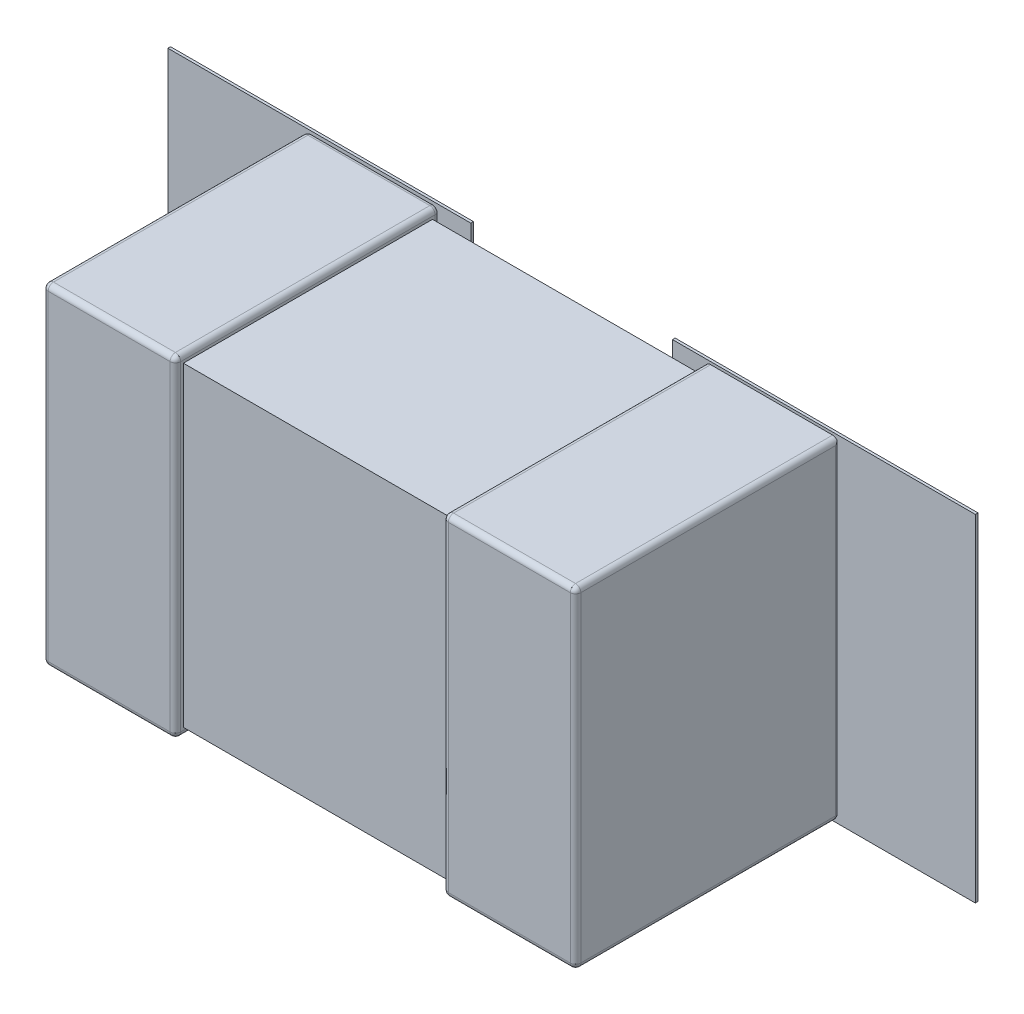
ISO-10303-21;
HEADER;
FILE_DESCRIPTION(('STEP AP214'),'2;1');
FILE_NAME('part.step','',(''),(''),'','','');
FILE_SCHEMA(('AUTOMOTIVE_DESIGN { 1 0 10303 214 1 1 1 1 }'));
ENDSEC;
DATA;
#1=APPLICATION_CONTEXT('core data for automotive mechanical design processes');
#2=APPLICATION_PROTOCOL_DEFINITION('international standard','automotive_design',2000,#1);
#3=PRODUCT_CONTEXT('',#1,'mechanical');
#4=PRODUCT('Part','Part','',(#3));
#5=PRODUCT_RELATED_PRODUCT_CATEGORY('part','',(#4));
#6=PRODUCT_DEFINITION_FORMATION('','',#4);
#7=PRODUCT_DEFINITION_CONTEXT('part definition',#1,'design');
#8=PRODUCT_DEFINITION('design','',#6,#7);
#9=PRODUCT_DEFINITION_SHAPE('','',#8);
#10=(LENGTH_UNIT() NAMED_UNIT(*) SI_UNIT(.MILLI.,.METRE.));
#11=(NAMED_UNIT(*) PLANE_ANGLE_UNIT() SI_UNIT($,.RADIAN.));
#12=(NAMED_UNIT(*) SI_UNIT($,.STERADIAN.) SOLID_ANGLE_UNIT());
#13=UNCERTAINTY_MEASURE_WITH_UNIT(LENGTH_MEASURE(1.E-05),#10,'distance_accuracy_value','');
#14=(GEOMETRIC_REPRESENTATION_CONTEXT(3) GLOBAL_UNCERTAINTY_ASSIGNED_CONTEXT((#13)) GLOBAL_UNIT_ASSIGNED_CONTEXT((#10,
#11,#12)) REPRESENTATION_CONTEXT('',''));
#15=CARTESIAN_POINT('',(0.,0.,0.));
#16=DIRECTION('',(0.,0.,1.));
#17=DIRECTION('',(1.,0.,0.));
#18=AXIS2_PLACEMENT_3D('',#15,#16,#17);
#19=CARTESIAN_POINT('',(0.98495100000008,-0.60496700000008,1.05619800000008));
#20=DIRECTION('',(0.707106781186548,0.,0.707106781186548));
#21=DIRECTION('',(0.,-1.,0.));
#22=AXIS2_PLACEMENT_3D('',#19,#20,#21);
#23=SPHERICAL_SURFACE('',#22,0.0199999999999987);
#24=CARTESIAN_POINT('',(0.98495100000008,-0.60496700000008,1.05619800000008));
#25=DIRECTION('',(1.,0.,0.));
#26=DIRECTION('',(0.,0.,-1.));
#27=AXIS2_PLACEMENT_3D('',#24,#25,#26);
#28=CIRCLE('',#27,0.0199999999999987);
#29=CARTESIAN_POINT('',(0.98495100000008,-0.624967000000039,1.05619800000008));
#30=VERTEX_POINT('',#29);
#31=CARTESIAN_POINT('',(0.98495100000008,-0.60496700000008,1.07619800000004));
#32=VERTEX_POINT('',#31);
#33=EDGE_CURVE('E392',#30,#32,#28,.F.);
#34=ORIENTED_EDGE('',*,*,#33,.F.);
#35=CARTESIAN_POINT('',(0.98495100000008,-0.60496700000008,1.05619800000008));
#36=DIRECTION('',(0.,0.,-1.));
#37=DIRECTION('',(-1.,0.,0.));
#38=AXIS2_PLACEMENT_3D('',#35,#36,#37);
#39=CIRCLE('',#38,0.0199999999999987);
#40=CARTESIAN_POINT('',(1.00495100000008,-0.60496700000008,1.05619800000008));
#41=VERTEX_POINT('',#40);
#42=EDGE_CURVE('E94',#41,#30,#39,.T.);
#43=ORIENTED_EDGE('',*,*,#42,.F.);
#44=CARTESIAN_POINT('',(0.98495100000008,-0.60496700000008,1.05619800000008));
#45=DIRECTION('',(0.,1.,0.));
#46=DIRECTION('',(0.,0.,1.));
#47=AXIS2_PLACEMENT_3D('',#44,#45,#46);
#48=CIRCLE('',#47,0.0199999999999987);
#49=CARTESIAN_POINT('',(0.99909313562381,-0.60496700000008,1.07034013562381));
#50=VERTEX_POINT('',#49);
#51=EDGE_CURVE('E54',#50,#41,#48,.T.);
#52=ORIENTED_EDGE('',*,*,#51,.F.);
#53=CARTESIAN_POINT('',(0.98495100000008,-0.60496700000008,1.05619800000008));
#54=DIRECTION('',(0.,1.,0.));
#55=DIRECTION('',(0.,0.,1.));
#56=AXIS2_PLACEMENT_3D('',#53,#54,#55);
#57=CIRCLE('',#56,0.0199999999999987);
#58=EDGE_CURVE('E35',#32,#50,#57,.T.);
#59=ORIENTED_EDGE('',*,*,#58,.F.);
#60=EDGE_LOOP('',(#34,#43,#52,#59));
#61=FACE_BOUND('',#60,.T.);
#62=ADVANCED_FACE('F16',(#61),#23,.T.);
#63=CARTESIAN_POINT('',(0.,0.,0.0762));
#64=DIRECTION('',(0.,0.,1.));
#65=DIRECTION('',(1.,0.,0.));
#66=AXIS2_PLACEMENT_3D('',#63,#64,#65);
#67=PLANE('',#66);
#68=DIRECTION('',(0.,1.,0.));
#69=VECTOR('',#68,1.);
#70=CARTESIAN_POINT('',(0.380500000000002,0.635,0.0762));
#71=LINE('',#70,#69);
#72=CARTESIAN_POINT('',(0.380500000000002,0.635,0.0762));
#73=VERTEX_POINT('',#72);
#74=CARTESIAN_POINT('',(0.380500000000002,-0.635,0.0762));
#75=VERTEX_POINT('',#74);
#76=EDGE_CURVE('E383',#73,#75,#71,.F.);
#77=ORIENTED_EDGE('',*,*,#76,.F.);
#78=DIRECTION('',(1.,0.,0.));
#79=VECTOR('',#78,1.);
#80=CARTESIAN_POINT('',(1.5235,0.635,0.0762));
#81=LINE('',#80,#79);
#82=CARTESIAN_POINT('',(1.5235,0.635,0.0762));
#83=VERTEX_POINT('',#82);
#84=EDGE_CURVE('E389',#83,#73,#81,.F.);
#85=ORIENTED_EDGE('',*,*,#84,.F.);
#86=DIRECTION('',(0.,1.,0.));
#87=VECTOR('',#86,1.);
#88=CARTESIAN_POINT('',(1.5235,-0.635,0.0762));
#89=LINE('',#88,#87);
#90=CARTESIAN_POINT('',(1.5235,-0.635,0.0762));
#91=VERTEX_POINT('',#90);
#92=EDGE_CURVE('E82',#91,#83,#89,.T.);
#93=ORIENTED_EDGE('',*,*,#92,.F.);
#94=DIRECTION('',(1.,0.,0.));
#95=VECTOR('',#94,1.);
#96=CARTESIAN_POINT('',(0.380500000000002,-0.635,0.0762));
#97=LINE('',#96,#95);
#98=EDGE_CURVE('E377',#75,#91,#97,.T.);
#99=ORIENTED_EDGE('',*,*,#98,.F.);
#100=EDGE_LOOP('',(#77,#85,#93,#99));
#101=FACE_BOUND('',#100,.T.);
#102=ADVANCED_FACE('F103',(#101),#67,.F.);
#103=CARTESIAN_POINT('',(0.98495100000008,0.60496700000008,1.05619800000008));
#104=DIRECTION('',(0.,0.707106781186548,0.707106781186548));
#105=DIRECTION('',(1.,0.,0.));
#106=AXIS2_PLACEMENT_3D('',#103,#104,#105);
#107=SPHERICAL_SURFACE('',#106,0.0199999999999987);
#108=CARTESIAN_POINT('',(0.98495100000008,0.60496700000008,1.05619800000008));
#109=DIRECTION('',(-1.,0.,0.));
#110=DIRECTION('',(0.,0.,1.));
#111=AXIS2_PLACEMENT_3D('',#108,#109,#110);
#112=CIRCLE('',#111,0.0199999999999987);
#113=CARTESIAN_POINT('',(0.98495100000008,0.61910913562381,1.07034013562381));
#114=VERTEX_POINT('',#113);
#115=CARTESIAN_POINT('',(0.98495100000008,0.624967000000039,1.05619800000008));
#116=VERTEX_POINT('',#115);
#117=EDGE_CURVE('E95',#114,#116,#112,.T.);
#118=ORIENTED_EDGE('',*,*,#117,.F.);
#119=CARTESIAN_POINT('',(0.98495100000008,0.60496700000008,1.05619800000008));
#120=DIRECTION('',(-1.,0.,0.));
#121=DIRECTION('',(0.,0.,1.));
#122=AXIS2_PLACEMENT_3D('',#119,#120,#121);
#123=CIRCLE('',#122,0.0199999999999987);
#124=CARTESIAN_POINT('',(0.98495100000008,0.60496700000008,1.07619800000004));
#125=VERTEX_POINT('',#124);
#126=EDGE_CURVE('E58',#125,#114,#123,.T.);
#127=ORIENTED_EDGE('',*,*,#126,.F.);
#128=CARTESIAN_POINT('',(0.98495100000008,0.60496700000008,1.05619800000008));
#129=DIRECTION('',(0.,1.,0.));
#130=DIRECTION('',(0.,0.,1.));
#131=AXIS2_PLACEMENT_3D('',#128,#129,#130);
#132=CIRCLE('',#131,0.0199999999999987);
#133=CARTESIAN_POINT('',(1.00495100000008,0.60496700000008,1.05619800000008));
#134=VERTEX_POINT('',#133);
#135=EDGE_CURVE('E20',#134,#125,#132,.F.);
#136=ORIENTED_EDGE('',*,*,#135,.F.);
#137=CARTESIAN_POINT('',(0.98495100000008,0.60496700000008,1.05619800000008));
#138=DIRECTION('',(0.,0.,-1.));
#139=DIRECTION('',(-1.,0.,0.));
#140=AXIS2_PLACEMENT_3D('',#137,#138,#139);
#141=CIRCLE('',#140,0.0199999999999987);
#142=EDGE_CURVE('E72',#116,#134,#141,.T.);
#143=ORIENTED_EDGE('',*,*,#142,.F.);
#144=EDGE_LOOP('',(#118,#127,#136,#143));
#145=FACE_BOUND('',#144,.T.);
#146=ADVANCED_FACE('F84',(#145),#107,.T.);
#147=CARTESIAN_POINT('',(1.004951,-0.624967,0.0762));
#148=DIRECTION('',(1.,0.,0.));
#149=DIRECTION('',(0.,0.,-1.));
#150=AXIS2_PLACEMENT_3D('',#147,#148,#149);
#151=PLANE('',#150);
#152=DIRECTION('',(0.,-1.,0.));
#153=VECTOR('',#152,1.);
#154=CARTESIAN_POINT('',(1.00495100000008,2.43846719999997,0.0961999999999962));
#155=LINE('',#154,#153);
#156=CARTESIAN_POINT('',(1.00495100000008,0.60496700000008,0.0961999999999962));
#157=VERTEX_POINT('',#156);
#158=CARTESIAN_POINT('',(1.00495100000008,-0.60496700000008,0.0961999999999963));
#159=VERTEX_POINT('',#158);
#160=EDGE_CURVE('E67',#157,#159,#155,.T.);
#161=ORIENTED_EDGE('',*,*,#160,.F.);
#162=DIRECTION('',(0.,0.,-1.));
#163=VECTOR('',#162,1.);
#164=CARTESIAN_POINT('',(1.00495100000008,0.60496700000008,2.3797953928));
#165=LINE('',#164,#163);
#166=EDGE_CURVE('E62',#134,#157,#165,.T.);
#167=ORIENTED_EDGE('',*,*,#166,.F.);
#168=DIRECTION('',(0.,1.,0.));
#169=VECTOR('',#168,1.);
#170=CARTESIAN_POINT('',(1.00495100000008,-2.43846719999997,1.05619800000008));
#171=LINE('',#170,#169);
#172=EDGE_CURVE('E49',#41,#134,#171,.T.);
#173=ORIENTED_EDGE('',*,*,#172,.F.);
#174=DIRECTION('',(0.,0.,-1.));
#175=VECTOR('',#174,1.);
#176=CARTESIAN_POINT('',(1.00495100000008,-0.60496700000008,2.3797953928));
#177=LINE('',#176,#175);
#178=EDGE_CURVE('E91',#159,#41,#177,.F.);
#179=ORIENTED_EDGE('',*,*,#178,.F.);
#180=EDGE_LOOP('',(#161,#167,#173,#179));
#181=FACE_BOUND('',#180,.T.);
#182=ADVANCED_FACE('F64',(#181),#151,.T.);
#183=CARTESIAN_POINT('',(0.98495100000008,-2.43846719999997,1.05619800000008));
#184=DIRECTION('',(0.,1.,0.));
#185=DIRECTION('',(0.,0.,1.));
#186=AXIS2_PLACEMENT_3D('',#183,#184,#185);
#187=CYLINDRICAL_SURFACE('',#186,0.0199999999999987);
#188=ORIENTED_EDGE('',*,*,#51,.T.);
#189=ORIENTED_EDGE('',*,*,#172,.T.);
#190=ORIENTED_EDGE('',*,*,#135,.T.);
#191=DIRECTION('',(0.,1.,0.));
#192=VECTOR('',#191,1.);
#193=CARTESIAN_POINT('',(0.98495100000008,0.,1.076198));
#194=LINE('',#193,#192);
#195=EDGE_CURVE('E89',#32,#125,#194,.T.);
#196=ORIENTED_EDGE('',*,*,#195,.F.);
#197=ORIENTED_EDGE('',*,*,#58,.T.);
#198=EDGE_LOOP('',(#188,#189,#190,#196,#197));
#199=FACE_BOUND('',#198,.T.);
#200=ADVANCED_FACE('F51',(#199),#187,.T.);
#201=CARTESIAN_POINT('',(5.4955692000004,0.60496700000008,1.05619800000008));
#202=DIRECTION('',(-1.,0.,0.));
#203=DIRECTION('',(0.,0.,1.));
#204=AXIS2_PLACEMENT_3D('',#201,#202,#203);
#205=CYLINDRICAL_SURFACE('',#204,0.0199999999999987);
#206=ORIENTED_EDGE('',*,*,#117,.T.);
#207=DIRECTION('',(1.,0.,0.));
#208=VECTOR('',#207,1.);
#209=CARTESIAN_POINT('',(1.004951,0.624967,1.05619800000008));
#210=LINE('',#209,#208);
#211=CARTESIAN_POINT('',(0.524950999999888,0.624967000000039,1.05619800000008));
#212=VERTEX_POINT('',#211);
#213=EDGE_CURVE('E415',#212,#116,#210,.T.);
#214=ORIENTED_EDGE('',*,*,#213,.F.);
#215=CARTESIAN_POINT('',(0.524950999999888,0.60496700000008,1.05619800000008));
#216=DIRECTION('',(-1.,0.,0.));
#217=DIRECTION('',(0.,0.,1.));
#218=AXIS2_PLACEMENT_3D('',#215,#216,#217);
#219=CIRCLE('',#218,0.0199999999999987);
#220=CARTESIAN_POINT('',(0.524950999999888,0.60496700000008,1.07619800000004));
#221=VERTEX_POINT('',#220);
#222=EDGE_CURVE('E416',#221,#212,#219,.T.);
#223=ORIENTED_EDGE('',*,*,#222,.F.);
#224=DIRECTION('',(1.,0.,0.));
#225=VECTOR('',#224,1.);
#226=CARTESIAN_POINT('',(0.,0.60496700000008,1.076198));
#227=LINE('',#226,#225);
#228=EDGE_CURVE('E420',#125,#221,#227,.F.);
#229=ORIENTED_EDGE('',*,*,#228,.F.);
#230=ORIENTED_EDGE('',*,*,#126,.T.);
#231=EDGE_LOOP('',(#206,#214,#223,#229,#230));
#232=FACE_BOUND('',#231,.T.);
#233=ADVANCED_FACE('F590',(#232),#205,.T.);
#234=CARTESIAN_POINT('',(0.98495100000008,-0.60496700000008,2.3797953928));
#235=DIRECTION('',(0.,0.,-1.));
#236=DIRECTION('',(-1.,0.,0.));
#237=AXIS2_PLACEMENT_3D('',#234,#235,#236);
#238=CYLINDRICAL_SURFACE('',#237,0.0199999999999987);
#239=ORIENTED_EDGE('',*,*,#42,.T.);
#240=DIRECTION('',(0.,0.,-1.));
#241=VECTOR('',#240,1.);
#242=CARTESIAN_POINT('',(0.98495100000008,-0.624967,0.0762));
#243=LINE('',#242,#241);
#244=CARTESIAN_POINT('',(0.98495100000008,-0.624967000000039,0.096199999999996));
#245=VERTEX_POINT('',#244);
#246=EDGE_CURVE('E393',#245,#30,#243,.F.);
#247=ORIENTED_EDGE('',*,*,#246,.F.);
#248=CARTESIAN_POINT('',(0.98495100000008,-0.60496700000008,0.0961999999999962));
#249=DIRECTION('',(0.,0.,-1.));
#250=DIRECTION('',(0.707106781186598,-0.707106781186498,0.));
#251=AXIS2_PLACEMENT_3D('',#248,#249,#250);
#252=CIRCLE('',#251,0.0199999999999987);
#253=CARTESIAN_POINT('',(0.999093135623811,-0.619109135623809,0.0961999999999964));
#254=VERTEX_POINT('',#253);
#255=EDGE_CURVE('E364',#254,#245,#252,.T.);
#256=ORIENTED_EDGE('',*,*,#255,.F.);
#257=CARTESIAN_POINT('',(0.98495100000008,-0.60496700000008,0.0961999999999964));
#258=DIRECTION('',(0.,0.,-1.));
#259=DIRECTION('',(-1.,0.,0.));
#260=AXIS2_PLACEMENT_3D('',#257,#258,#259);
#261=CIRCLE('',#260,0.0199999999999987);
#262=EDGE_CURVE('E368',#159,#254,#261,.T.);
#263=ORIENTED_EDGE('',*,*,#262,.F.);
#264=ORIENTED_EDGE('',*,*,#178,.T.);
#265=EDGE_LOOP('',(#239,#247,#256,#263,#264));
#266=FACE_BOUND('',#265,.T.);
#267=ADVANCED_FACE('F638',(#266),#238,.T.);
#268=CARTESIAN_POINT('',(-5.4955692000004,-0.60496700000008,1.05619800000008));
#269=DIRECTION('',(1.,0.,0.));
#270=DIRECTION('',(0.,0.,-1.));
#271=AXIS2_PLACEMENT_3D('',#268,#269,#270);
#272=CYLINDRICAL_SURFACE('',#271,0.0199999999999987);
#273=ORIENTED_EDGE('',*,*,#33,.T.);
#274=DIRECTION('',(1.,0.,0.));
#275=VECTOR('',#274,1.);
#276=CARTESIAN_POINT('',(0.,-0.60496700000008,1.076198));
#277=LINE('',#276,#275);
#278=CARTESIAN_POINT('',(0.524950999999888,-0.60496700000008,1.07619800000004));
#279=VERTEX_POINT('',#278);
#280=EDGE_CURVE('E491',#279,#32,#277,.T.);
#281=ORIENTED_EDGE('',*,*,#280,.F.);
#282=CARTESIAN_POINT('',(0.524950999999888,-0.60496700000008,1.05619800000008));
#283=DIRECTION('',(1.,0.,0.));
#284=DIRECTION('',(0.,0.,-1.));
#285=AXIS2_PLACEMENT_3D('',#282,#283,#284);
#286=CIRCLE('',#285,0.0199999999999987);
#287=CARTESIAN_POINT('',(0.524950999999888,-0.624967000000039,1.05619800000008));
#288=VERTEX_POINT('',#287);
#289=EDGE_CURVE('E395',#288,#279,#286,.F.);
#290=ORIENTED_EDGE('',*,*,#289,.F.);
#291=DIRECTION('',(1.,0.,0.));
#292=VECTOR('',#291,1.);
#293=CARTESIAN_POINT('',(-1.004951,-0.624967,1.05619800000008));
#294=LINE('',#293,#292);
#295=EDGE_CURVE('E419',#30,#288,#294,.F.);
#296=ORIENTED_EDGE('',*,*,#295,.F.);
#297=EDGE_LOOP('',(#273,#281,#290,#296));
#298=FACE_BOUND('',#297,.T.);
#299=ADVANCED_FACE('F647',(#298),#272,.T.);
#300=CARTESIAN_POINT('',(1.5235,0.635,0.0762));
#301=DIRECTION('',(0.,1.,0.));
#302=DIRECTION('',(0.,0.,1.));
#303=AXIS2_PLACEMENT_3D('',#300,#301,#302);
#304=PLANE('',#303);
#305=DIRECTION('',(0.,0.,-1.));
#306=VECTOR('',#305,1.);
#307=CARTESIAN_POINT('',(1.5235,0.635,0.0762));
#308=LINE('',#307,#306);
#309=CARTESIAN_POINT('',(1.5235,0.635,0.0862000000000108));
#310=VERTEX_POINT('',#309);
#311=EDGE_CURVE('E374',#83,#310,#308,.F.);
#312=ORIENTED_EDGE('',*,*,#311,.F.);
#313=ORIENTED_EDGE('',*,*,#84,.T.);
#314=DIRECTION('',(0.,0.,1.));
#315=VECTOR('',#314,1.);
#316=CARTESIAN_POINT('',(0.380500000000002,0.635,0.0762));
#317=LINE('',#316,#315);
#318=CARTESIAN_POINT('',(0.380500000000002,0.635,0.0862000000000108));
#319=VERTEX_POINT('',#318);
#320=EDGE_CURVE('E386',#319,#73,#317,.F.);
#321=ORIENTED_EDGE('',*,*,#320,.F.);
#322=DIRECTION('',(1.,0.,0.));
#323=VECTOR('',#322,1.);
#324=CARTESIAN_POINT('',(0.,0.635,0.0862000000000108));
#325=LINE('',#324,#323);
#326=EDGE_CURVE('E424',#310,#319,#325,.F.);
#327=ORIENTED_EDGE('',*,*,#326,.F.);
#328=EDGE_LOOP('',(#312,#313,#321,#327));
#329=FACE_BOUND('',#328,.T.);
#330=ADVANCED_FACE('F1408',(#329),#304,.T.);
#331=CARTESIAN_POINT('',(0.380500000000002,0.635,0.0762));
#332=DIRECTION('',(-1.,0.,0.));
#333=DIRECTION('',(0.,0.,1.));
#334=AXIS2_PLACEMENT_3D('',#331,#332,#333);
#335=PLANE('',#334);
#336=ORIENTED_EDGE('',*,*,#320,.T.);
#337=ORIENTED_EDGE('',*,*,#76,.T.);
#338=DIRECTION('',(0.,0.,-1.));
#339=VECTOR('',#338,1.);
#340=CARTESIAN_POINT('',(0.380500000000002,-0.635,0.0762));
#341=LINE('',#340,#339);
#342=CARTESIAN_POINT('',(0.380500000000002,-0.635,0.0862000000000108));
#343=VERTEX_POINT('',#342);
#344=EDGE_CURVE('E380',#343,#75,#341,.T.);
#345=ORIENTED_EDGE('',*,*,#344,.F.);
#346=DIRECTION('',(0.,1.,0.));
#347=VECTOR('',#346,1.);
#348=CARTESIAN_POINT('',(0.380500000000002,0.,0.0862000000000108));
#349=LINE('',#348,#347);
#350=EDGE_CURVE('E432',#319,#343,#349,.F.);
#351=ORIENTED_EDGE('',*,*,#350,.F.);
#352=EDGE_LOOP('',(#336,#337,#345,#351));
#353=FACE_BOUND('',#352,.T.);
#354=ADVANCED_FACE('F1503',(#353),#335,.T.);
#355=CARTESIAN_POINT('',(0.380500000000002,-0.635,0.0762));
#356=DIRECTION('',(0.,-1.,0.));
#357=DIRECTION('',(0.,0.,-1.));
#358=AXIS2_PLACEMENT_3D('',#355,#356,#357);
#359=PLANE('',#358);
#360=ORIENTED_EDGE('',*,*,#344,.T.);
#361=ORIENTED_EDGE('',*,*,#98,.T.);
#362=DIRECTION('',(0.,0.,-1.));
#363=VECTOR('',#362,1.);
#364=CARTESIAN_POINT('',(1.5235,-0.635,0.0762));
#365=LINE('',#364,#363);
#366=CARTESIAN_POINT('',(1.5235,-0.635,0.0862000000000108));
#367=VERTEX_POINT('',#366);
#368=EDGE_CURVE('E371',#367,#91,#365,.T.);
#369=ORIENTED_EDGE('',*,*,#368,.F.);
#370=DIRECTION('',(1.,0.,0.));
#371=VECTOR('',#370,1.);
#372=CARTESIAN_POINT('',(0.,-0.635,0.0862000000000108));
#373=LINE('',#372,#371);
#374=EDGE_CURVE('E440',#343,#367,#373,.T.);
#375=ORIENTED_EDGE('',*,*,#374,.F.);
#376=EDGE_LOOP('',(#360,#361,#369,#375));
#377=FACE_BOUND('',#376,.T.);
#378=ADVANCED_FACE('F1496',(#377),#359,.T.);
#379=CARTESIAN_POINT('',(1.5235,-0.635,0.0762));
#380=DIRECTION('',(1.,0.,0.));
#381=DIRECTION('',(0.,0.,-1.));
#382=AXIS2_PLACEMENT_3D('',#379,#380,#381);
#383=PLANE('',#382);
#384=ORIENTED_EDGE('',*,*,#368,.T.);
#385=ORIENTED_EDGE('',*,*,#92,.T.);
#386=ORIENTED_EDGE('',*,*,#311,.T.);
#387=DIRECTION('',(0.,1.,0.));
#388=VECTOR('',#387,1.);
#389=CARTESIAN_POINT('',(1.5235,0.,0.0862000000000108));
#390=LINE('',#389,#388);
#391=EDGE_CURVE('E518',#367,#310,#390,.T.);
#392=ORIENTED_EDGE('',*,*,#391,.F.);
#393=EDGE_LOOP('',(#384,#385,#386,#392));
#394=FACE_BOUND('',#393,.T.);
#395=ADVANCED_FACE('F1397',(#394),#383,.T.);
#396=CARTESIAN_POINT('',(0.98495100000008,0.60496700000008,2.3797953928));
#397=DIRECTION('',(0.,0.,-1.));
#398=DIRECTION('',(-1.,0.,0.));
#399=AXIS2_PLACEMENT_3D('',#396,#397,#398);
#400=CYLINDRICAL_SURFACE('',#399,0.0199999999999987);
#401=CARTESIAN_POINT('',(0.98495100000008,0.60496700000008,0.0961999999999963));
#402=DIRECTION('',(0.,-0.707106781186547,-0.707106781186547));
#403=DIRECTION('',(0.,-0.707106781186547,0.707106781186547));
#404=AXIS2_PLACEMENT_3D('',#401,#402,#403);
#405=ELLIPSE('',#404,0.0282842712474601,0.0199999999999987);
#406=CARTESIAN_POINT('',(1.00227150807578,0.614967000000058,0.0862000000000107));
#407=VERTEX_POINT('',#406);
#408=EDGE_CURVE('E71',#407,#157,#405,.T.);
#409=ORIENTED_EDGE('',*,*,#408,.F.);
#410=CARTESIAN_POINT('',(0.98495100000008,0.60496700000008,0.0862000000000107));
#411=DIRECTION('',(0.,0.,-1.));
#412=DIRECTION('',(-1.,0.,0.));
#413=AXIS2_PLACEMENT_3D('',#410,#411,#412);
#414=CIRCLE('',#413,0.0199999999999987);
#415=CARTESIAN_POINT('',(0.98495100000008,0.624967,0.0862000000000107));
#416=VERTEX_POINT('',#415);
#417=EDGE_CURVE('E347',#416,#407,#414,.T.);
#418=ORIENTED_EDGE('',*,*,#417,.F.);
#419=DIRECTION('',(0.,0.,1.));
#420=VECTOR('',#419,1.);
#421=CARTESIAN_POINT('',(0.98495100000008,0.624967,0.0762));
#422=LINE('',#421,#420);
#423=EDGE_CURVE('E79',#116,#416,#422,.F.);
#424=ORIENTED_EDGE('',*,*,#423,.F.);
#425=ORIENTED_EDGE('',*,*,#142,.T.);
#426=ORIENTED_EDGE('',*,*,#166,.T.);
#427=EDGE_LOOP('',(#409,#418,#424,#425,#426));
#428=FACE_BOUND('',#427,.T.);
#429=ADVANCED_FACE('F76',(#428),#400,.T.);
#430=CARTESIAN_POINT('',(0.98495100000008,2.43846719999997,0.0961999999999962));
#431=DIRECTION('',(0.,-1.,0.));
#432=DIRECTION('',(0.,0.,-1.));
#433=AXIS2_PLACEMENT_3D('',#430,#431,#432);
#434=CYLINDRICAL_SURFACE('',#433,0.0199999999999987);
#435=CARTESIAN_POINT('',(0.98495100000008,-0.60496700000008,0.0961999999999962));
#436=DIRECTION('',(0.,-1.,0.));
#437=DIRECTION('',(0.,0.,-1.));
#438=AXIS2_PLACEMENT_3D('',#435,#436,#437);
#439=CIRCLE('',#438,0.0199999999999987);
#440=CARTESIAN_POINT('',(1.00227150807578,-0.60496700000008,0.0862000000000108));
#441=VERTEX_POINT('',#440);
#442=EDGE_CURVE('E96',#441,#159,#439,.T.);
#443=ORIENTED_EDGE('',*,*,#442,.F.);
#444=DIRECTION('',(0.,1.,0.));
#445=VECTOR('',#444,1.);
#446=CARTESIAN_POINT('',(1.00227150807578,0.,0.0862000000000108));
#447=LINE('',#446,#445);
#448=EDGE_CURVE('E346',#407,#441,#447,.F.);
#449=ORIENTED_EDGE('',*,*,#448,.F.);
#450=ORIENTED_EDGE('',*,*,#408,.T.);
#451=ORIENTED_EDGE('',*,*,#160,.T.);
#452=EDGE_LOOP('',(#443,#449,#450,#451));
#453=FACE_BOUND('',#452,.T.);
#454=ADVANCED_FACE('F356',(#453),#434,.T.);
#455=CARTESIAN_POINT('',(0.98495100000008,-0.60496700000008,0.0961999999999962));
#456=DIRECTION('',(0.707106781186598,-0.707106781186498,0.));
#457=DIRECTION('',(0.,0.,-1.));
#458=AXIS2_PLACEMENT_3D('',#455,#456,#457);
#459=SPHERICAL_SURFACE('',#458,0.0199999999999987);
#460=CARTESIAN_POINT('',(0.98495100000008,-0.60496700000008,0.0961999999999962));
#461=DIRECTION('',(-1.,0.,0.));
#462=DIRECTION('',(0.,0.,1.));
#463=AXIS2_PLACEMENT_3D('',#460,#461,#462);
#464=CIRCLE('',#463,0.0199999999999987);
#465=CARTESIAN_POINT('',(0.98495100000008,-0.62228750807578,0.0862000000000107));
#466=VERTEX_POINT('',#465);
#467=EDGE_CURVE('E367',#466,#245,#464,.T.);
#468=ORIENTED_EDGE('',*,*,#467,.F.);
#469=CARTESIAN_POINT('',(1.00227150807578,-0.60496700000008,0.0862000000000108));
#470=CARTESIAN_POINT('',(1.00228438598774,-0.60691927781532,0.0862000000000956));
#471=CARTESIAN_POINT('',(1.00194331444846,-0.608863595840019,0.0862000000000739));
#472=CARTESIAN_POINT('',(1.00064694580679,-0.612536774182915,0.0862000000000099));
#473=CARTESIAN_POINT('',(0.999691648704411,-0.614265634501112,0.0861999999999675));
#474=CARTESIAN_POINT('',(0.99726050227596,-0.617308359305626,0.0862000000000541));
#475=CARTESIAN_POINT('',(0.995784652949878,-0.618622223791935,0.086200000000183));
#476=CARTESIAN_POINT('',(0.992479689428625,-0.620685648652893,0.0862000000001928));
#477=CARTESIAN_POINT('',(0.990650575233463,-0.621435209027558,0.0862000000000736));
#478=CARTESIAN_POINT('',(0.987505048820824,-0.622147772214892,0.0861999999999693));
#479=CARTESIAN_POINT('',(0.986227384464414,-0.622292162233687,0.0861999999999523));
#480=CARTESIAN_POINT('',(0.98495100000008,-0.622287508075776,0.0862000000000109));
#481=B_SPLINE_CURVE_WITH_KNOTS('',3,(#469,#470,#471,#472,#473,#474,#475,#476,#477,#478,#479,
#480),.UNSPECIFIED.,.F.,.F.,(4,2,2,2,2,4),(0.,0.00581573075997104,0.0116314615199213,
0.0174471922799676,0.0232629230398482,0.0270884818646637),.UNSPECIFIED.);
#482=EDGE_CURVE('E338',#441,#466,#481,.T.);
#483=ORIENTED_EDGE('',*,*,#482,.F.);
#484=ORIENTED_EDGE('',*,*,#442,.T.);
#485=ORIENTED_EDGE('',*,*,#262,.T.);
#486=ORIENTED_EDGE('',*,*,#255,.T.);
#487=EDGE_LOOP('',(#468,#483,#484,#485,#486));
#488=FACE_BOUND('',#487,.T.);
#489=ADVANCED_FACE('F349',(#488),#459,.T.);
#490=CARTESIAN_POINT('',(5.4955692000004,-0.60496700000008,0.0961999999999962));
#491=DIRECTION('',(-1.,0.,0.));
#492=DIRECTION('',(0.,0.,1.));
#493=AXIS2_PLACEMENT_3D('',#490,#491,#492);
#494=CYLINDRICAL_SURFACE('',#493,0.0199999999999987);
#495=CARTESIAN_POINT('',(0.524950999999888,-0.60496700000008,0.0961999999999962));
#496=DIRECTION('',(-1.,0.,0.));
#497=DIRECTION('',(0.,0.,1.));
#498=AXIS2_PLACEMENT_3D('',#495,#496,#497);
#499=CIRCLE('',#498,0.0199999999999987);
#500=CARTESIAN_POINT('',(0.524950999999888,-0.62228750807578,0.0862000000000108));
#501=VERTEX_POINT('',#500);
#502=CARTESIAN_POINT('',(0.524950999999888,-0.624967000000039,0.0961999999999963));
#503=VERTEX_POINT('',#502);
#504=EDGE_CURVE('E422',#501,#503,#499,.T.);
#505=ORIENTED_EDGE('',*,*,#504,.F.);
#506=DIRECTION('',(1.,0.,0.));
#507=VECTOR('',#506,1.);
#508=CARTESIAN_POINT('',(0.,-0.622287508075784,0.0862000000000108));
#509=LINE('',#508,#507);
#510=EDGE_CURVE('E345',#466,#501,#509,.F.);
#511=ORIENTED_EDGE('',*,*,#510,.F.);
#512=ORIENTED_EDGE('',*,*,#467,.T.);
#513=DIRECTION('',(1.,0.,0.));
#514=VECTOR('',#513,1.);
#515=CARTESIAN_POINT('',(-1.004951,-0.624967,0.0961999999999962));
#516=LINE('',#515,#514);
#517=EDGE_CURVE('E396',#503,#245,#516,.T.);
#518=ORIENTED_EDGE('',*,*,#517,.F.);
#519=EDGE_LOOP('',(#505,#511,#512,#518));
#520=FACE_BOUND('',#519,.T.);
#521=ADVANCED_FACE('F355',(#520),#494,.T.);
#522=CARTESIAN_POINT('',(1.004951,0.624967,0.0762));
#523=DIRECTION('',(0.,1.,0.));
#524=DIRECTION('',(0.,0.,1.));
#525=AXIS2_PLACEMENT_3D('',#522,#523,#524);
#526=PLANE('',#525);
#527=ORIENTED_EDGE('',*,*,#423,.T.);
#528=DIRECTION('',(1.,0.,0.));
#529=VECTOR('',#528,1.);
#530=CARTESIAN_POINT('',(0.,0.624967,0.0862000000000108));
#531=LINE('',#530,#529);
#532=CARTESIAN_POINT('',(0.524950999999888,0.624967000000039,0.0862000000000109));
#533=VERTEX_POINT('',#532);
#534=EDGE_CURVE('E507',#533,#416,#531,.T.);
#535=ORIENTED_EDGE('',*,*,#534,.F.);
#536=DIRECTION('',(0.,0.,1.));
#537=VECTOR('',#536,1.);
#538=CARTESIAN_POINT('',(0.524950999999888,0.624967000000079,-1.2273973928));
#539=LINE('',#538,#537);
#540=EDGE_CURVE('E496',#212,#533,#539,.F.);
#541=ORIENTED_EDGE('',*,*,#540,.F.);
#542=ORIENTED_EDGE('',*,*,#213,.T.);
#543=EDGE_LOOP('',(#527,#535,#541,#542));
#544=FACE_BOUND('',#543,.T.);
#545=ADVANCED_FACE('F505',(#544),#526,.T.);
#546=CARTESIAN_POINT('',(0.,0.,1.076198));
#547=DIRECTION('',(0.,0.,1.));
#548=DIRECTION('',(1.,0.,0.));
#549=AXIS2_PLACEMENT_3D('',#546,#547,#548);
#550=PLANE('',#549);
#551=ORIENTED_EDGE('',*,*,#195,.T.);
#552=ORIENTED_EDGE('',*,*,#228,.T.);
#553=DIRECTION('',(0.,-1.,0.));
#554=VECTOR('',#553,1.);
#555=CARTESIAN_POINT('',(0.524950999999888,2.43846719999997,1.07619800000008));
#556=LINE('',#555,#554);
#557=EDGE_CURVE('E489',#279,#221,#556,.F.);
#558=ORIENTED_EDGE('',*,*,#557,.F.);
#559=ORIENTED_EDGE('',*,*,#280,.T.);
#560=EDGE_LOOP('',(#551,#552,#558,#559));
#561=FACE_BOUND('',#560,.T.);
#562=ADVANCED_FACE('F484',(#561),#550,.T.);
#563=CARTESIAN_POINT('',(0.524950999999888,0.60496700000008,1.05619800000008));
#564=DIRECTION('',(-0.707106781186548,0.,0.707106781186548));
#565=DIRECTION('',(0.,1.,0.));
#566=AXIS2_PLACEMENT_3D('',#563,#564,#565);
#567=SPHERICAL_SURFACE('',#566,0.0199999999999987);
#568=ORIENTED_EDGE('',*,*,#222,.T.);
#569=CARTESIAN_POINT('',(0.524950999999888,0.60496700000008,1.05619800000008));
#570=DIRECTION('',(0.,0.,1.));
#571=DIRECTION('',(1.,0.,0.));
#572=AXIS2_PLACEMENT_3D('',#569,#570,#571);
#573=CIRCLE('',#572,0.0199999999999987);
#574=CARTESIAN_POINT('',(0.504950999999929,0.60496700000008,1.05619800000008));
#575=VERTEX_POINT('',#574);
#576=EDGE_CURVE('E499',#575,#212,#573,.F.);
#577=ORIENTED_EDGE('',*,*,#576,.F.);
#578=CARTESIAN_POINT('',(0.524950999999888,0.60496700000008,1.05619800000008));
#579=DIRECTION('',(0.,-1.,0.));
#580=DIRECTION('',(0.,0.,-1.));
#581=AXIS2_PLACEMENT_3D('',#578,#579,#580);
#582=CIRCLE('',#581,0.0199999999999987);
#583=CARTESIAN_POINT('',(0.510808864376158,0.60496700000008,1.07034013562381));
#584=VERTEX_POINT('',#583);
#585=EDGE_CURVE('E530',#584,#575,#582,.T.);
#586=ORIENTED_EDGE('',*,*,#585,.F.);
#587=CARTESIAN_POINT('',(0.524950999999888,0.60496700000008,1.05619800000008));
#588=DIRECTION('',(0.,-1.,0.));
#589=DIRECTION('',(0.,0.,-1.));
#590=AXIS2_PLACEMENT_3D('',#587,#588,#589);
#591=CIRCLE('',#590,0.0199999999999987);
#592=EDGE_CURVE('E527',#221,#584,#591,.T.);
#593=ORIENTED_EDGE('',*,*,#592,.F.);
#594=EDGE_LOOP('',(#568,#577,#586,#593));
#595=FACE_BOUND('',#594,.T.);
#596=ADVANCED_FACE('F479',(#595),#567,.T.);
#597=CARTESIAN_POINT('',(-1.004951,-0.624967,0.0762));
#598=DIRECTION('',(0.,-1.,0.));
#599=DIRECTION('',(0.,0.,-1.));
#600=AXIS2_PLACEMENT_3D('',#597,#598,#599);
#601=PLANE('',#600);
#602=ORIENTED_EDGE('',*,*,#517,.T.);
#603=ORIENTED_EDGE('',*,*,#246,.T.);
#604=ORIENTED_EDGE('',*,*,#295,.T.);
#605=DIRECTION('',(0.,0.,-1.));
#606=VECTOR('',#605,1.);
#607=CARTESIAN_POINT('',(0.524950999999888,-0.624967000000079,2.3797953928));
#608=LINE('',#607,#606);
#609=EDGE_CURVE('E464',#503,#288,#608,.F.);
#610=ORIENTED_EDGE('',*,*,#609,.F.);
#611=EDGE_LOOP('',(#602,#603,#604,#610));
#612=FACE_BOUND('',#611,.T.);
#613=ADVANCED_FACE('F475',(#612),#601,.T.);
#614=CARTESIAN_POINT('',(0.524950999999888,-0.60496700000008,1.05619800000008));
#615=DIRECTION('',(-0.707106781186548,-0.707106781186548,0.));
#616=DIRECTION('',(0.,0.,1.));
#617=AXIS2_PLACEMENT_3D('',#614,#615,#616);
#618=SPHERICAL_SURFACE('',#617,0.0199999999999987);
#619=ORIENTED_EDGE('',*,*,#289,.T.);
#620=CARTESIAN_POINT('',(0.524950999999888,-0.60496700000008,1.05619800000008));
#621=DIRECTION('',(0.,-1.,0.));
#622=DIRECTION('',(0.,0.,-1.));
#623=AXIS2_PLACEMENT_3D('',#620,#621,#622);
#624=CIRCLE('',#623,0.0199999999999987);
#625=CARTESIAN_POINT('',(0.504950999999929,-0.60496700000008,1.05619800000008));
#626=VERTEX_POINT('',#625);
#627=EDGE_CURVE('E468',#626,#279,#624,.F.);
#628=ORIENTED_EDGE('',*,*,#627,.F.);
#629=CARTESIAN_POINT('',(0.524950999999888,-0.60496700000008,1.05619800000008));
#630=DIRECTION('',(0.,0.,-1.));
#631=DIRECTION('',(-1.,0.,0.));
#632=AXIS2_PLACEMENT_3D('',#629,#630,#631);
#633=CIRCLE('',#632,0.0199999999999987);
#634=CARTESIAN_POINT('',(0.510808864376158,-0.61910913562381,1.05619800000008));
#635=VERTEX_POINT('',#634);
#636=EDGE_CURVE('E533',#635,#626,#633,.T.);
#637=ORIENTED_EDGE('',*,*,#636,.F.);
#638=CARTESIAN_POINT('',(0.524950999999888,-0.60496700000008,1.05619800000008));
#639=DIRECTION('',(0.,0.,-1.));
#640=DIRECTION('',(-1.,0.,0.));
#641=AXIS2_PLACEMENT_3D('',#638,#639,#640);
#642=CIRCLE('',#641,0.0199999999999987);
#643=EDGE_CURVE('E467',#288,#635,#642,.T.);
#644=ORIENTED_EDGE('',*,*,#643,.F.);
#645=EDGE_LOOP('',(#619,#628,#637,#644));
#646=FACE_BOUND('',#645,.T.);
#647=ADVANCED_FACE('F472',(#646),#618,.T.);
#648=CARTESIAN_POINT('',(0.524950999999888,-0.60496700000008,0.0961999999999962));
#649=DIRECTION('',(-0.707106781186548,0.,-0.707106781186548));
#650=DIRECTION('',(0.,-1.,0.));
#651=AXIS2_PLACEMENT_3D('',#648,#649,#650);
#652=SPHERICAL_SURFACE('',#651,0.0199999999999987);
#653=CARTESIAN_POINT('',(0.524950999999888,-0.60496700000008,0.0961999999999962));
#654=DIRECTION('',(0.,1.,0.));
#655=DIRECTION('',(0.,0.,1.));
#656=AXIS2_PLACEMENT_3D('',#653,#654,#655);
#657=CIRCLE('',#656,0.0199999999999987);
#658=CARTESIAN_POINT('',(0.507630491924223,-0.60496700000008,0.0861999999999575));
#659=VERTEX_POINT('',#658);
#660=CARTESIAN_POINT('',(0.504950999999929,-0.60496700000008,0.0961999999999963));
#661=VERTEX_POINT('',#660);
#662=EDGE_CURVE('E449',#659,#661,#657,.T.);
#663=ORIENTED_EDGE('',*,*,#662,.F.);
#664=CARTESIAN_POINT('',(0.524950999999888,-0.622287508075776,0.0862000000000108));
#665=CARTESIAN_POINT('',(0.522998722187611,-0.622300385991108,0.0862000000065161));
#666=CARTESIAN_POINT('',(0.521054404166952,-0.621959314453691,0.0862000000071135));
#667=CARTESIAN_POINT('',(0.517381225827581,-0.620662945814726,0.0862000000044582));
#668=CARTESIAN_POINT('',(0.515652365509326,-0.619707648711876,0.0862000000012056));
#669=CARTESIAN_POINT('',(0.512609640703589,-0.617276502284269,0.086199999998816));
#670=CARTESIAN_POINT('',(0.511295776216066,-0.615800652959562,0.0861999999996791));
#671=CARTESIAN_POINT('',(0.509232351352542,-0.612495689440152,0.0862000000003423));
#672=CARTESIAN_POINT('',(0.508482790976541,-0.610666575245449,0.0862000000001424));
#673=CARTESIAN_POINT('',(0.507770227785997,-0.607521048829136,0.0861999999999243));
#674=CARTESIAN_POINT('',(0.507625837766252,-0.606243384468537,0.0861999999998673));
#675=CARTESIAN_POINT('',(0.507630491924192,-0.60496700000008,0.0862000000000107));
#676=B_SPLINE_CURVE_WITH_KNOTS('',3,(#664,#665,#666,#667,#668,#669,#670,#671,#672,#673,#674,
#675),.UNSPECIFIED.,.F.,.F.,(4,2,2,2,2,4),(0.,0.00581573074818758,0.0116314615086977,
0.0174471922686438,0.0232629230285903,0.027088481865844),.UNSPECIFIED.);
#677=EDGE_CURVE('E332',#501,#659,#676,.T.);
#678=ORIENTED_EDGE('',*,*,#677,.F.);
#679=ORIENTED_EDGE('',*,*,#504,.T.);
#680=CARTESIAN_POINT('',(0.524950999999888,-0.60496700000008,0.0961999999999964));
#681=DIRECTION('',(0.,0.,-1.));
#682=DIRECTION('',(-1.,0.,0.));
#683=AXIS2_PLACEMENT_3D('',#680,#681,#682);
#684=CIRCLE('',#683,0.0199999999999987);
#685=EDGE_CURVE('E452',#661,#503,#684,.F.);
#686=ORIENTED_EDGE('',*,*,#685,.F.);
#687=EDGE_LOOP('',(#663,#678,#679,#686));
#688=FACE_BOUND('',#687,.T.);
#689=ADVANCED_FACE('F325',(#688),#652,.T.);
#690=CARTESIAN_POINT('',(0.,0.,0.0862000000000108));
#691=DIRECTION('',(0.,0.,1.));
#692=DIRECTION('',(1.,0.,0.));
#693=AXIS2_PLACEMENT_3D('',#690,#691,#692);
#694=PLANE('',#693);
#695=CARTESIAN_POINT('',(0.524950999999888,0.60496700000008,0.0862000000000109));
#696=DIRECTION('',(0.,0.,1.));
#697=DIRECTION('',(1.,0.,0.));
#698=AXIS2_PLACEMENT_3D('',#695,#696,#697);
#699=CIRCLE('',#698,0.0199999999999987);
#700=CARTESIAN_POINT('',(0.507630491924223,0.614967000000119,0.0861999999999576));
#701=VERTEX_POINT('',#700);
#702=EDGE_CURVE('E498',#533,#701,#699,.T.);
#703=ORIENTED_EDGE('',*,*,#702,.F.);
#704=ORIENTED_EDGE('',*,*,#534,.T.);
#705=ORIENTED_EDGE('',*,*,#417,.T.);
#706=ORIENTED_EDGE('',*,*,#448,.T.);
#707=ORIENTED_EDGE('',*,*,#482,.T.);
#708=ORIENTED_EDGE('',*,*,#510,.T.);
#709=ORIENTED_EDGE('',*,*,#677,.T.);
#710=DIRECTION('',(0.,1.,0.));
#711=VECTOR('',#710,1.);
#712=CARTESIAN_POINT('',(0.507630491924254,-2.43846719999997,0.0861999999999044));
#713=LINE('',#712,#711);
#714=EDGE_CURVE('E444',#701,#659,#713,.F.);
#715=ORIENTED_EDGE('',*,*,#714,.F.);
#716=EDGE_LOOP('',(#703,#704,#705,#706,#707,#708,#709,#715));
#717=FACE_BOUND('',#716,.T.);
#718=ORIENTED_EDGE('',*,*,#374,.T.);
#719=ORIENTED_EDGE('',*,*,#391,.T.);
#720=ORIENTED_EDGE('',*,*,#326,.T.);
#721=ORIENTED_EDGE('',*,*,#350,.T.);
#722=EDGE_LOOP('',(#718,#719,#720,#721));
#723=FACE_BOUND('',#722,.T.);
#724=ADVANCED_FACE('F320',(#717,#723),#694,.T.);
#725=CARTESIAN_POINT('',(0.524950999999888,0.60496700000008,-1.2273973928));
#726=DIRECTION('',(0.,0.,1.));
#727=DIRECTION('',(1.,0.,0.));
#728=AXIS2_PLACEMENT_3D('',#725,#726,#727);
#729=CYLINDRICAL_SURFACE('',#728,0.0199999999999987);
#730=ORIENTED_EDGE('',*,*,#540,.T.);
#731=ORIENTED_EDGE('',*,*,#702,.T.);
#732=CARTESIAN_POINT('',(0.524950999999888,0.60496700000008,0.0961999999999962));
#733=DIRECTION('',(0.,0.707106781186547,0.707106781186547));
#734=DIRECTION('',(0.,0.707106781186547,-0.707106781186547));
#735=AXIS2_PLACEMENT_3D('',#732,#733,#734);
#736=ELLIPSE('',#735,0.0282842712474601,0.0199999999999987);
#737=CARTESIAN_POINT('',(0.504950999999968,0.60496700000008,0.0961999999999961));
#738=VERTEX_POINT('',#737);
#739=EDGE_CURVE('E448',#738,#701,#736,.F.);
#740=ORIENTED_EDGE('',*,*,#739,.F.);
#741=DIRECTION('',(0.,0.,-1.));
#742=VECTOR('',#741,1.);
#743=CARTESIAN_POINT('',(0.504950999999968,0.60496700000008,0.106200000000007));
#744=LINE('',#743,#742);
#745=EDGE_CURVE('E447',#738,#575,#744,.F.);
#746=ORIENTED_EDGE('',*,*,#745,.T.);
#747=ORIENTED_EDGE('',*,*,#576,.T.);
#748=EDGE_LOOP('',(#730,#731,#740,#746,#747));
#749=FACE_BOUND('',#748,.T.);
#750=ADVANCED_FACE('F316',(#749),#729,.T.);
#751=CARTESIAN_POINT('',(0.524950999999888,2.43846719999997,1.05619800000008));
#752=DIRECTION('',(0.,-1.,0.));
#753=DIRECTION('',(0.,0.,-1.));
#754=AXIS2_PLACEMENT_3D('',#751,#752,#753);
#755=CYLINDRICAL_SURFACE('',#754,0.0199999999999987);
#756=DIRECTION('',(0.,1.,0.));
#757=VECTOR('',#756,1.);
#758=CARTESIAN_POINT('',(0.504950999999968,-0.624967,1.05619800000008));
#759=LINE('',#758,#757);
#760=EDGE_CURVE('E455',#575,#626,#759,.F.);
#761=ORIENTED_EDGE('',*,*,#760,.T.);
#762=ORIENTED_EDGE('',*,*,#627,.T.);
#763=ORIENTED_EDGE('',*,*,#557,.T.);
#764=ORIENTED_EDGE('',*,*,#592,.T.);
#765=ORIENTED_EDGE('',*,*,#585,.T.);
#766=EDGE_LOOP('',(#761,#762,#763,#764,#765));
#767=FACE_BOUND('',#766,.T.);
#768=ADVANCED_FACE('F312',(#767),#755,.T.);
#769=CARTESIAN_POINT('',(0.524950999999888,-0.60496700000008,2.3797953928));
#770=DIRECTION('',(0.,0.,-1.));
#771=DIRECTION('',(-1.,0.,0.));
#772=AXIS2_PLACEMENT_3D('',#769,#770,#771);
#773=CYLINDRICAL_SURFACE('',#772,0.0199999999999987);
#774=DIRECTION('',(0.,0.,-1.));
#775=VECTOR('',#774,1.);
#776=CARTESIAN_POINT('',(0.504950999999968,-0.60496700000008,0.106200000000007));
#777=LINE('',#776,#775);
#778=EDGE_CURVE('E459',#626,#661,#777,.T.);
#779=ORIENTED_EDGE('',*,*,#778,.T.);
#780=ORIENTED_EDGE('',*,*,#685,.T.);
#781=ORIENTED_EDGE('',*,*,#609,.T.);
#782=ORIENTED_EDGE('',*,*,#643,.T.);
#783=ORIENTED_EDGE('',*,*,#636,.T.);
#784=EDGE_LOOP('',(#779,#780,#781,#782,#783));
#785=FACE_BOUND('',#784,.T.);
#786=ADVANCED_FACE('F308',(#785),#773,.T.);
#787=CARTESIAN_POINT('',(0.524950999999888,-2.43846719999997,0.0961999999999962));
#788=DIRECTION('',(0.,1.,0.));
#789=DIRECTION('',(0.,0.,1.));
#790=AXIS2_PLACEMENT_3D('',#787,#788,#789);
#791=CYLINDRICAL_SURFACE('',#790,0.0199999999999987);
#792=ORIENTED_EDGE('',*,*,#739,.T.);
#793=ORIENTED_EDGE('',*,*,#714,.T.);
#794=ORIENTED_EDGE('',*,*,#662,.T.);
#795=DIRECTION('',(0.,1.,0.));
#796=VECTOR('',#795,1.);
#797=CARTESIAN_POINT('',(0.504950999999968,-0.624967,0.0961999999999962));
#798=LINE('',#797,#796);
#799=EDGE_CURVE('E456',#661,#738,#798,.T.);
#800=ORIENTED_EDGE('',*,*,#799,.T.);
#801=EDGE_LOOP('',(#792,#793,#794,#800));
#802=FACE_BOUND('',#801,.T.);
#803=ADVANCED_FACE('F304',(#802),#791,.T.);
#804=CARTESIAN_POINT('',(0.,0.,1.076198));
#805=DIRECTION('',(0.,0.,1.));
#806=DIRECTION('',(1.,0.,0.));
#807=AXIS2_PLACEMENT_3D('',#804,#805,#806);
#808=PLANE('',#807);
#809=DIRECTION('',(0.,-1.,0.));
#810=VECTOR('',#809,1.);
#811=CARTESIAN_POINT('',(-0.98495100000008,2.43846719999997,1.07619800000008));
#812=LINE('',#811,#810);
#813=CARTESIAN_POINT('',(-0.98495100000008,-0.60496700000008,1.07619800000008));
#814=VERTEX_POINT('',#813);
#815=CARTESIAN_POINT('',(-0.98495100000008,0.604967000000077,1.07619800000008));
#816=VERTEX_POINT('',#815);
#817=EDGE_CURVE('E538',#814,#816,#812,.F.);
#818=ORIENTED_EDGE('',*,*,#817,.F.);
#819=DIRECTION('',(1.,0.,0.));
#820=VECTOR('',#819,1.);
#821=CARTESIAN_POINT('',(-5.4955692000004,-0.60496700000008,1.07619800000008));
#822=LINE('',#821,#820);
#823=CARTESIAN_POINT('',(-0.524950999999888,-0.60496700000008,1.07619800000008));
#824=VERTEX_POINT('',#823);
#825=EDGE_CURVE('E534',#824,#814,#822,.F.);
#826=ORIENTED_EDGE('',*,*,#825,.F.);
#827=DIRECTION('',(0.,1.,0.));
#828=VECTOR('',#827,1.);
#829=CARTESIAN_POINT('',(-0.524950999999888,-2.43846719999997,1.07619800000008));
#830=LINE('',#829,#828);
#831=CARTESIAN_POINT('',(-0.524950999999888,0.60496700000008,1.07619800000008));
#832=VERTEX_POINT('',#831);
#833=EDGE_CURVE('E291',#832,#824,#830,.F.);
#834=ORIENTED_EDGE('',*,*,#833,.F.);
#835=DIRECTION('',(-1.,0.,0.));
#836=VECTOR('',#835,1.);
#837=CARTESIAN_POINT('',(5.4955692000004,0.60496700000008,1.07619800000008));
#838=LINE('',#837,#836);
#839=EDGE_CURVE('E542',#816,#832,#838,.F.);
#840=ORIENTED_EDGE('',*,*,#839,.F.);
#841=EDGE_LOOP('',(#818,#826,#834,#840));
#842=FACE_BOUND('',#841,.T.);
#843=ADVANCED_FACE('F300',(#842),#808,.T.);
#844=CARTESIAN_POINT('',(0.504950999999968,-0.624967,0.106200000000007));
#845=DIRECTION('',(1.,0.,0.));
#846=DIRECTION('',(0.,0.,-1.));
#847=AXIS2_PLACEMENT_3D('',#844,#845,#846);
#848=PLANE('',#847);
#849=DIRECTION('',(0.,1.,0.));
#850=VECTOR('',#849,1.);
#851=CARTESIAN_POINT('',(0.504950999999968,0.624967,1.04619800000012));
#852=LINE('',#851,#850);
#853=CARTESIAN_POINT('',(0.504950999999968,0.59496700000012,1.04619800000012));
#854=VERTEX_POINT('',#853);
#855=CARTESIAN_POINT('',(0.504950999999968,-0.59496700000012,1.04619800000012));
#856=VERTEX_POINT('',#855);
#857=EDGE_CURVE('E964',#854,#856,#852,.F.);
#858=ORIENTED_EDGE('',*,*,#857,.T.);
#859=DIRECTION('',(0.,0.,1.));
#860=VECTOR('',#859,1.);
#861=CARTESIAN_POINT('',(0.504950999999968,-0.59496700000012,1.076198));
#862=LINE('',#861,#860);
#863=CARTESIAN_POINT('',(0.504950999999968,-0.59496700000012,0.106200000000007));
#864=VERTEX_POINT('',#863);
#865=EDGE_CURVE('E979',#856,#864,#862,.F.);
#866=ORIENTED_EDGE('',*,*,#865,.T.);
#867=DIRECTION('',(0.,1.,0.));
#868=VECTOR('',#867,1.);
#869=CARTESIAN_POINT('',(0.504950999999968,-0.624967,0.106200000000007));
#870=LINE('',#869,#868);
#871=CARTESIAN_POINT('',(0.504950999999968,0.59496700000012,0.106200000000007));
#872=VERTEX_POINT('',#871);
#873=EDGE_CURVE('E975',#864,#872,#870,.T.);
#874=ORIENTED_EDGE('',*,*,#873,.T.);
#875=DIRECTION('',(0.,0.,-1.));
#876=VECTOR('',#875,1.);
#877=CARTESIAN_POINT('',(0.504950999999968,0.59496700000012,0.0762));
#878=LINE('',#877,#876);
#879=EDGE_CURVE('E970',#872,#854,#878,.F.);
#880=ORIENTED_EDGE('',*,*,#879,.T.);
#881=EDGE_LOOP('',(#858,#866,#874,#880));
#882=FACE_BOUND('',#881,.T.);
#883=ORIENTED_EDGE('',*,*,#778,.F.);
#884=ORIENTED_EDGE('',*,*,#760,.F.);
#885=ORIENTED_EDGE('',*,*,#745,.F.);
#886=ORIENTED_EDGE('',*,*,#799,.F.);
#887=EDGE_LOOP('',(#883,#884,#885,#886));
#888=FACE_BOUND('',#887,.T.);
#889=ADVANCED_FACE('F296',(#882,#888),#848,.F.);
#890=CARTESIAN_POINT('',(-0.524950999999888,-0.60496700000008,1.05619800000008));
#891=DIRECTION('',(0.707106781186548,0.,0.707106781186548));
#892=DIRECTION('',(0.,-1.,0.));
#893=AXIS2_PLACEMENT_3D('',#890,#891,#892);
#894=SPHERICAL_SURFACE('',#893,0.0199999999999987);
#895=CARTESIAN_POINT('',(-0.524950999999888,-0.60496700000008,1.05619800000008));
#896=DIRECTION('',(0.,1.,0.));
#897=DIRECTION('',(0.,0.,1.));
#898=AXIS2_PLACEMENT_3D('',#895,#896,#897);
#899=CIRCLE('',#898,0.0199999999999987);
#900=CARTESIAN_POINT('',(-0.510808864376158,-0.60496700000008,1.07034013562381));
#901=VERTEX_POINT('',#900);
#902=CARTESIAN_POINT('',(-0.504950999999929,-0.60496700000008,1.05619800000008));
#903=VERTEX_POINT('',#902);
#904=EDGE_CURVE('E932',#901,#903,#899,.T.);
#905=ORIENTED_EDGE('',*,*,#904,.F.);
#906=CARTESIAN_POINT('',(-0.524950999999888,-0.60496700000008,1.05619800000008));
#907=DIRECTION('',(0.,1.,0.));
#908=DIRECTION('',(0.,0.,1.));
#909=AXIS2_PLACEMENT_3D('',#906,#907,#908);
#910=CIRCLE('',#909,0.0199999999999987);
#911=EDGE_CURVE('E552',#824,#901,#910,.T.);
#912=ORIENTED_EDGE('',*,*,#911,.F.);
#913=CARTESIAN_POINT('',(-0.524950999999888,-0.60496700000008,1.05619800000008));
#914=DIRECTION('',(1.,0.,0.));
#915=DIRECTION('',(0.,0.,-1.));
#916=AXIS2_PLACEMENT_3D('',#913,#914,#915);
#917=CIRCLE('',#916,0.0199999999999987);
#918=CARTESIAN_POINT('',(-0.524950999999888,-0.624967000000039,1.05619800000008));
#919=VERTEX_POINT('',#918);
#920=EDGE_CURVE('E458',#919,#824,#917,.F.);
#921=ORIENTED_EDGE('',*,*,#920,.F.);
#922=CARTESIAN_POINT('',(-0.524950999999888,-0.60496700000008,1.05619800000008));
#923=DIRECTION('',(0.,0.,1.));
#924=DIRECTION('',(1.,0.,0.));
#925=AXIS2_PLACEMENT_3D('',#922,#923,#924);
#926=CIRCLE('',#925,0.0199999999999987);
#927=EDGE_CURVE('E927',#903,#919,#926,.F.);
#928=ORIENTED_EDGE('',*,*,#927,.F.);
#929=EDGE_LOOP('',(#905,#912,#921,#928));
#930=FACE_BOUND('',#929,.T.);
#931=ADVANCED_FACE('F293',(#930),#894,.T.);
#932=CARTESIAN_POINT('',(-5.4955692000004,-0.60496700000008,1.05619800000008));
#933=DIRECTION('',(1.,0.,0.));
#934=DIRECTION('',(0.,0.,-1.));
#935=AXIS2_PLACEMENT_3D('',#932,#933,#934);
#936=CYLINDRICAL_SURFACE('',#935,0.0199999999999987);
#937=CARTESIAN_POINT('',(-0.98495100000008,-0.60496700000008,1.05619800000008));
#938=DIRECTION('',(1.,0.,0.));
#939=DIRECTION('',(0.,0.,-1.));
#940=AXIS2_PLACEMENT_3D('',#937,#938,#939);
#941=CIRCLE('',#940,0.0199999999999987);
#942=CARTESIAN_POINT('',(-0.98495100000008,-0.624967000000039,1.05619800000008));
#943=VERTEX_POINT('',#942);
#944=EDGE_CURVE('E537',#943,#814,#941,.F.);
#945=ORIENTED_EDGE('',*,*,#944,.F.);
#946=DIRECTION('',(1.,0.,0.));
#947=VECTOR('',#946,1.);
#948=CARTESIAN_POINT('',(-1.004951,-0.624967,1.05619800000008));
#949=LINE('',#948,#947);
#950=EDGE_CURVE('E284',#919,#943,#949,.F.);
#951=ORIENTED_EDGE('',*,*,#950,.F.);
#952=ORIENTED_EDGE('',*,*,#920,.T.);
#953=ORIENTED_EDGE('',*,*,#825,.T.);
#954=EDGE_LOOP('',(#945,#951,#952,#953));
#955=FACE_BOUND('',#954,.T.);
#956=ADVANCED_FACE('F277',(#955),#936,.T.);
#957=CARTESIAN_POINT('',(-0.98495100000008,-0.60496700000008,1.05619800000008));
#958=DIRECTION('',(-0.707106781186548,-0.707106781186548,0.));
#959=DIRECTION('',(0.,0.,1.));
#960=AXIS2_PLACEMENT_3D('',#957,#958,#959);
#961=SPHERICAL_SURFACE('',#960,0.0199999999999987);
#962=CARTESIAN_POINT('',(-0.98495100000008,-0.60496700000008,1.05619800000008));
#963=DIRECTION('',(0.,0.,-1.));
#964=DIRECTION('',(-1.,0.,0.));
#965=AXIS2_PLACEMENT_3D('',#962,#963,#964);
#966=CIRCLE('',#965,0.0199999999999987);
#967=CARTESIAN_POINT('',(-0.99909313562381,-0.61910913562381,1.05619800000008));
#968=VERTEX_POINT('',#967);
#969=CARTESIAN_POINT('',(-1.00495100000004,-0.60496700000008,1.05619800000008));
#970=VERTEX_POINT('',#969);
#971=EDGE_CURVE('E924',#968,#970,#966,.T.);
#972=ORIENTED_EDGE('',*,*,#971,.F.);
#973=CARTESIAN_POINT('',(-0.98495100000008,-0.60496700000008,1.05619800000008));
#974=DIRECTION('',(0.,0.,-1.));
#975=DIRECTION('',(-1.,0.,0.));
#976=AXIS2_PLACEMENT_3D('',#973,#974,#975);
#977=CIRCLE('',#976,0.0199999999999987);
#978=EDGE_CURVE('E283',#943,#968,#977,.T.);
#979=ORIENTED_EDGE('',*,*,#978,.F.);
#980=ORIENTED_EDGE('',*,*,#944,.T.);
#981=CARTESIAN_POINT('',(-0.98495100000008,-0.60496700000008,1.05619800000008));
#982=DIRECTION('',(0.,-1.,0.));
#983=DIRECTION('',(0.,0.,-1.));
#984=AXIS2_PLACEMENT_3D('',#981,#982,#983);
#985=CIRCLE('',#984,0.0199999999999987);
#986=EDGE_CURVE('E541',#970,#814,#985,.F.);
#987=ORIENTED_EDGE('',*,*,#986,.F.);
#988=EDGE_LOOP('',(#972,#979,#980,#987));
#989=FACE_BOUND('',#988,.T.);
#990=ADVANCED_FACE('F272',(#989),#961,.T.);
#991=CARTESIAN_POINT('',(-0.98495100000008,2.43846719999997,1.05619800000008));
#992=DIRECTION('',(0.,-1.,0.));
#993=DIRECTION('',(0.,0.,-1.));
#994=AXIS2_PLACEMENT_3D('',#991,#992,#993);
#995=CYLINDRICAL_SURFACE('',#994,0.0199999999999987);
#996=ORIENTED_EDGE('',*,*,#986,.T.);
#997=ORIENTED_EDGE('',*,*,#817,.T.);
#998=CARTESIAN_POINT('',(-0.98495100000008,0.60496700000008,1.05619800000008));
#999=DIRECTION('',(2.96540569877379E-13,1.,2.96540569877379E-13));
#1000=DIRECTION('',(-0.707106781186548,0.,0.707106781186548));
#1001=AXIS2_PLACEMENT_3D('',#998,#999,#1000);
#1002=CIRCLE('',#1001,0.0199999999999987);
#1003=CARTESIAN_POINT('',(-0.99909313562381,0.60496700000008,1.07034013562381));
#1004=VERTEX_POINT('',#1003);
#1005=EDGE_CURVE('E263',#1004,#816,#1002,.T.);
#1006=ORIENTED_EDGE('',*,*,#1005,.F.);
#1007=CARTESIAN_POINT('',(-0.98495100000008,0.60496700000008,1.05619800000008));
#1008=DIRECTION('',(0.,-1.,0.));
#1009=DIRECTION('',(0.,0.,-1.));
#1010=AXIS2_PLACEMENT_3D('',#1007,#1008,#1009);
#1011=CIRCLE('',#1010,0.0199999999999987);
#1012=CARTESIAN_POINT('',(-1.00495100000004,0.60496700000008,1.05619800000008));
#1013=VERTEX_POINT('',#1012);
#1014=EDGE_CURVE('E540',#1013,#1004,#1011,.F.);
#1015=ORIENTED_EDGE('',*,*,#1014,.F.);
#1016=DIRECTION('',(0.,1.,0.));
#1017=VECTOR('',#1016,1.);
#1018=CARTESIAN_POINT('',(-1.004951,0.624967,1.05619800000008));
#1019=LINE('',#1018,#1017);
#1020=EDGE_CURVE('E926',#970,#1013,#1019,.T.);
#1021=ORIENTED_EDGE('',*,*,#1020,.F.);
#1022=EDGE_LOOP('',(#996,#997,#1006,#1015,#1021));
#1023=FACE_BOUND('',#1022,.T.);
#1024=ADVANCED_FACE('F268',(#1023),#995,.T.);
#1025=CARTESIAN_POINT('',(-0.98495100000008,0.60496700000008,1.05619800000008));
#1026=DIRECTION('',(-0.707106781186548,0.,0.707106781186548));
#1027=DIRECTION('',(0.,1.,0.));
#1028=AXIS2_PLACEMENT_3D('',#1025,#1026,#1027);
#1029=SPHERICAL_SURFACE('',#1028,0.0199999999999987);
#1030=ORIENTED_EDGE('',*,*,#1005,.T.);
#1031=CARTESIAN_POINT('',(-0.98495100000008,0.60496700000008,1.05619800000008));
#1032=DIRECTION('',(-1.,0.,0.));
#1033=DIRECTION('',(0.,0.,1.));
#1034=AXIS2_PLACEMENT_3D('',#1031,#1032,#1033);
#1035=CIRCLE('',#1034,0.0199999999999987);
#1036=CARTESIAN_POINT('',(-0.98495100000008,0.624967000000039,1.05619800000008));
#1037=VERTEX_POINT('',#1036);
#1038=EDGE_CURVE('E545',#1037,#816,#1035,.F.);
#1039=ORIENTED_EDGE('',*,*,#1038,.F.);
#1040=CARTESIAN_POINT('',(-0.98495100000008,0.60496700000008,1.05619800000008));
#1041=DIRECTION('',(0.,0.,-1.));
#1042=DIRECTION('',(-1.,0.,0.));
#1043=AXIS2_PLACEMENT_3D('',#1040,#1041,#1042);
#1044=CIRCLE('',#1043,0.0199999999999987);
#1045=EDGE_CURVE('E921',#1013,#1037,#1044,.T.);
#1046=ORIENTED_EDGE('',*,*,#1045,.F.);
#1047=ORIENTED_EDGE('',*,*,#1014,.T.);
#1048=EDGE_LOOP('',(#1030,#1039,#1046,#1047));
#1049=FACE_BOUND('',#1048,.T.);
#1050=ADVANCED_FACE('F265',(#1049),#1029,.T.);
#1051=CARTESIAN_POINT('',(5.4955692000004,0.60496700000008,1.05619800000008));
#1052=DIRECTION('',(-1.,0.,0.));
#1053=DIRECTION('',(0.,0.,1.));
#1054=AXIS2_PLACEMENT_3D('',#1051,#1052,#1053);
#1055=CYLINDRICAL_SURFACE('',#1054,0.0199999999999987);
#1056=ORIENTED_EDGE('',*,*,#1038,.T.);
#1057=ORIENTED_EDGE('',*,*,#839,.T.);
#1058=CARTESIAN_POINT('',(-0.524950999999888,0.60496700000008,1.05619800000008));
#1059=DIRECTION('',(-1.,0.,0.));
#1060=DIRECTION('',(0.,0.,1.));
#1061=AXIS2_PLACEMENT_3D('',#1058,#1059,#1060);
#1062=CIRCLE('',#1061,0.0199999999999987);
#1063=CARTESIAN_POINT('',(-0.524950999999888,0.624967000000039,1.05619800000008));
#1064=VERTEX_POINT('',#1063);
#1065=EDGE_CURVE('E544',#1064,#832,#1062,.F.);
#1066=ORIENTED_EDGE('',*,*,#1065,.F.);
#1067=DIRECTION('',(1.,0.,0.));
#1068=VECTOR('',#1067,1.);
#1069=CARTESIAN_POINT('',(1.004951,0.624967,1.05619800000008));
#1070=LINE('',#1069,#1068);
#1071=EDGE_CURVE('E259',#1037,#1064,#1070,.T.);
#1072=ORIENTED_EDGE('',*,*,#1071,.F.);
#1073=EDGE_LOOP('',(#1056,#1057,#1066,#1072));
#1074=FACE_BOUND('',#1073,.T.);
#1075=ADVANCED_FACE('F253',(#1074),#1055,.T.);
#1076=CARTESIAN_POINT('',(-0.524950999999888,0.60496700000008,1.05619800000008));
#1077=DIRECTION('',(0.707106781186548,0.707106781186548,0.));
#1078=DIRECTION('',(0.,0.,1.));
#1079=AXIS2_PLACEMENT_3D('',#1076,#1077,#1078);
#1080=SPHERICAL_SURFACE('',#1079,0.0199999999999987);
#1081=CARTESIAN_POINT('',(-0.524950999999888,0.60496700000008,1.05619800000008));
#1082=DIRECTION('',(0.,0.,-1.));
#1083=DIRECTION('',(-1.,0.,0.));
#1084=AXIS2_PLACEMENT_3D('',#1081,#1082,#1083);
#1085=CIRCLE('',#1084,0.0199999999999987);
#1086=CARTESIAN_POINT('',(-0.510808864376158,0.61910913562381,1.05619800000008));
#1087=VERTEX_POINT('',#1086);
#1088=EDGE_CURVE('E920',#1064,#1087,#1085,.T.);
#1089=ORIENTED_EDGE('',*,*,#1088,.F.);
#1090=ORIENTED_EDGE('',*,*,#1065,.T.);
#1091=CARTESIAN_POINT('',(-0.524950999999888,0.60496700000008,1.05619800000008));
#1092=DIRECTION('',(0.,1.,0.));
#1093=DIRECTION('',(0.,0.,1.));
#1094=AXIS2_PLACEMENT_3D('',#1091,#1092,#1093);
#1095=CIRCLE('',#1094,0.0199999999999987);
#1096=CARTESIAN_POINT('',(-0.504950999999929,0.60496700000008,1.05619800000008));
#1097=VERTEX_POINT('',#1096);
#1098=EDGE_CURVE('E930',#1097,#832,#1095,.F.);
#1099=ORIENTED_EDGE('',*,*,#1098,.F.);
#1100=CARTESIAN_POINT('',(-0.524950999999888,0.60496700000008,1.05619800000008));
#1101=DIRECTION('',(0.,0.,-1.));
#1102=DIRECTION('',(-1.,0.,0.));
#1103=AXIS2_PLACEMENT_3D('',#1100,#1101,#1102);
#1104=CIRCLE('',#1103,0.0199999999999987);
#1105=EDGE_CURVE('E917',#1087,#1097,#1104,.T.);
#1106=ORIENTED_EDGE('',*,*,#1105,.F.);
#1107=EDGE_LOOP('',(#1089,#1090,#1099,#1106));
#1108=FACE_BOUND('',#1107,.T.);
#1109=ADVANCED_FACE('F248',(#1108),#1080,.T.);
#1110=CARTESIAN_POINT('',(-0.524950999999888,-2.43846719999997,1.05619800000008));
#1111=DIRECTION('',(0.,1.,0.));
#1112=DIRECTION('',(0.,0.,1.));
#1113=AXIS2_PLACEMENT_3D('',#1110,#1111,#1112);
#1114=CYLINDRICAL_SURFACE('',#1113,0.0199999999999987);
#1115=ORIENTED_EDGE('',*,*,#1098,.T.);
#1116=ORIENTED_EDGE('',*,*,#833,.T.);
#1117=ORIENTED_EDGE('',*,*,#911,.T.);
#1118=ORIENTED_EDGE('',*,*,#904,.T.);
#1119=DIRECTION('',(0.,1.,0.));
#1120=VECTOR('',#1119,1.);
#1121=CARTESIAN_POINT('',(-0.504950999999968,-0.624967,1.05619800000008));
#1122=LINE('',#1121,#1120);
#1123=EDGE_CURVE('E940',#903,#1097,#1122,.T.);
#1124=ORIENTED_EDGE('',*,*,#1123,.T.);
#1125=EDGE_LOOP('',(#1115,#1116,#1117,#1118,#1124));
#1126=FACE_BOUND('',#1125,.T.);
#1127=ADVANCED_FACE('F244',(#1126),#1114,.T.);
#1128=CARTESIAN_POINT('',(-0.504950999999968,-0.59496700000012,1.076198));
#1129=DIRECTION('',(0.,1.,0.));
#1130=DIRECTION('',(0.,0.,1.));
#1131=AXIS2_PLACEMENT_3D('',#1128,#1129,#1130);
#1132=PLANE('',#1131);
#1133=DIRECTION('',(1.,0.,0.));
#1134=VECTOR('',#1133,1.);
#1135=CARTESIAN_POINT('',(-0.504950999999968,-0.59496700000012,0.106200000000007));
#1136=LINE('',#1135,#1134);
#1137=CARTESIAN_POINT('',(-0.504950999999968,-0.59496700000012,0.106200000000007));
#1138=VERTEX_POINT('',#1137);
#1139=EDGE_CURVE('E977',#1138,#864,#1136,.T.);
#1140=ORIENTED_EDGE('',*,*,#1139,.T.);
#1141=ORIENTED_EDGE('',*,*,#865,.F.);
#1142=DIRECTION('',(-1.,0.,0.));
#1143=VECTOR('',#1142,1.);
#1144=CARTESIAN_POINT('',(-0.504950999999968,-0.59496700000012,1.04619800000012));
#1145=LINE('',#1144,#1143);
#1146=CARTESIAN_POINT('',(-0.504950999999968,-0.59496700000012,1.04619800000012));
#1147=VERTEX_POINT('',#1146);
#1148=EDGE_CURVE('E929',#856,#1147,#1145,.T.);
#1149=ORIENTED_EDGE('',*,*,#1148,.T.);
#1150=DIRECTION('',(0.,0.,1.));
#1151=VECTOR('',#1150,1.);
#1152=CARTESIAN_POINT('',(-0.504950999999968,-0.59496700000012,0.0762));
#1153=LINE('',#1152,#1151);
#1154=EDGE_CURVE('E1018',#1147,#1138,#1153,.F.);
#1155=ORIENTED_EDGE('',*,*,#1154,.T.);
#1156=EDGE_LOOP('',(#1140,#1141,#1149,#1155));
#1157=FACE_BOUND('',#1156,.T.);
#1158=ADVANCED_FACE('F240',(#1157),#1132,.F.);
#1159=CARTESIAN_POINT('',(-0.504950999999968,-0.624967,0.106200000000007));
#1160=DIRECTION('',(0.,0.,1.));
#1161=DIRECTION('',(1.,0.,0.));
#1162=AXIS2_PLACEMENT_3D('',#1159,#1160,#1161);
#1163=PLANE('',#1162);
#1164=DIRECTION('',(1.,0.,0.));
#1165=VECTOR('',#1164,1.);
#1166=CARTESIAN_POINT('',(-0.504950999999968,0.59496700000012,0.106200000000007));
#1167=LINE('',#1166,#1165);
#1168=CARTESIAN_POINT('',(-0.504950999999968,0.59496700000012,0.106200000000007));
#1169=VERTEX_POINT('',#1168);
#1170=EDGE_CURVE('E972',#1169,#872,#1167,.T.);
#1171=ORIENTED_EDGE('',*,*,#1170,.T.);
#1172=ORIENTED_EDGE('',*,*,#873,.F.);
#1173=ORIENTED_EDGE('',*,*,#1139,.F.);
#1174=DIRECTION('',(0.,1.,0.));
#1175=VECTOR('',#1174,1.);
#1176=CARTESIAN_POINT('',(-0.504950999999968,-0.624967,0.106200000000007));
#1177=LINE('',#1176,#1175);
#1178=EDGE_CURVE('E1015',#1138,#1169,#1177,.T.);
#1179=ORIENTED_EDGE('',*,*,#1178,.T.);
#1180=EDGE_LOOP('',(#1171,#1172,#1173,#1179));
#1181=FACE_BOUND('',#1180,.T.);
#1182=ADVANCED_FACE('F236',(#1181),#1163,.F.);
#1183=CARTESIAN_POINT('',(-0.504950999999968,0.59496700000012,0.0762));
#1184=DIRECTION('',(0.,-1.,0.));
#1185=DIRECTION('',(0.,0.,-1.));
#1186=AXIS2_PLACEMENT_3D('',#1183,#1184,#1185);
#1187=PLANE('',#1186);
#1188=DIRECTION('',(-1.,0.,0.));
#1189=VECTOR('',#1188,1.);
#1190=CARTESIAN_POINT('',(-0.504950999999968,0.59496700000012,1.04619800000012));
#1191=LINE('',#1190,#1189);
#1192=CARTESIAN_POINT('',(-0.504950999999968,0.59496700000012,1.04619800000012));
#1193=VERTEX_POINT('',#1192);
#1194=EDGE_CURVE('E967',#1193,#854,#1191,.F.);
#1195=ORIENTED_EDGE('',*,*,#1194,.T.);
#1196=ORIENTED_EDGE('',*,*,#879,.F.);
#1197=ORIENTED_EDGE('',*,*,#1170,.F.);
#1198=DIRECTION('',(0.,0.,1.));
#1199=VECTOR('',#1198,1.);
#1200=CARTESIAN_POINT('',(-0.504950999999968,0.59496700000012,0.0762));
#1201=LINE('',#1200,#1199);
#1202=EDGE_CURVE('E1012',#1169,#1193,#1201,.T.);
#1203=ORIENTED_EDGE('',*,*,#1202,.T.);
#1204=EDGE_LOOP('',(#1195,#1196,#1197,#1203));
#1205=FACE_BOUND('',#1204,.T.);
#1206=ADVANCED_FACE('F232',(#1205),#1187,.F.);
#1207=CARTESIAN_POINT('',(-0.504950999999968,0.624967,1.04619800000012));
#1208=DIRECTION('',(0.,0.,-1.));
#1209=DIRECTION('',(-1.,0.,0.));
#1210=AXIS2_PLACEMENT_3D('',#1207,#1208,#1209);
#1211=PLANE('',#1210);
#1212=ORIENTED_EDGE('',*,*,#1148,.F.);
#1213=ORIENTED_EDGE('',*,*,#857,.F.);
#1214=ORIENTED_EDGE('',*,*,#1194,.F.);
#1215=DIRECTION('',(0.,1.,0.));
#1216=VECTOR('',#1215,1.);
#1217=CARTESIAN_POINT('',(-0.504950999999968,-0.624967,1.04619800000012));
#1218=LINE('',#1217,#1216);
#1219=EDGE_CURVE('E916',#1193,#1147,#1218,.F.);
#1220=ORIENTED_EDGE('',*,*,#1219,.T.);
#1221=EDGE_LOOP('',(#1212,#1213,#1214,#1220));
#1222=FACE_BOUND('',#1221,.T.);
#1223=ADVANCED_FACE('F228',(#1222),#1211,.F.);
#1224=CARTESIAN_POINT('',(-0.524950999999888,-0.60496700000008,-1.2273973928));
#1225=DIRECTION('',(0.,0.,1.));
#1226=DIRECTION('',(1.,0.,0.));
#1227=AXIS2_PLACEMENT_3D('',#1224,#1225,#1226);
#1228=CYLINDRICAL_SURFACE('',#1227,0.0199999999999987);
#1229=ORIENTED_EDGE('',*,*,#927,.T.);
#1230=DIRECTION('',(0.,0.,-1.));
#1231=VECTOR('',#1230,1.);
#1232=CARTESIAN_POINT('',(-0.524950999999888,-0.624967,0.0762));
#1233=LINE('',#1232,#1231);
#1234=CARTESIAN_POINT('',(-0.524950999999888,-0.624967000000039,0.096199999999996));
#1235=VERTEX_POINT('',#1234);
#1236=EDGE_CURVE('E288',#1235,#919,#1233,.F.);
#1237=ORIENTED_EDGE('',*,*,#1236,.F.);
#1238=CARTESIAN_POINT('',(-0.524950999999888,-0.60496700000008,0.0961999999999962));
#1239=DIRECTION('',(0.,0.,-1.));
#1240=DIRECTION('',(0.707106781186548,-0.707106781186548,0.));
#1241=AXIS2_PLACEMENT_3D('',#1238,#1239,#1240);
#1242=CIRCLE('',#1241,0.0199999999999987);
#1243=CARTESIAN_POINT('',(-0.510808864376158,-0.61910913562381,0.0961999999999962));
#1244=VERTEX_POINT('',#1243);
#1245=EDGE_CURVE('E190',#1244,#1235,#1242,.T.);
#1246=ORIENTED_EDGE('',*,*,#1245,.F.);
#1247=CARTESIAN_POINT('',(-0.524950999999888,-0.60496700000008,0.0961999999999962));
#1248=DIRECTION('',(0.,0.,1.));
#1249=DIRECTION('',(1.,0.,0.));
#1250=AXIS2_PLACEMENT_3D('',#1247,#1248,#1249);
#1251=CIRCLE('',#1250,0.0199999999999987);
#1252=CARTESIAN_POINT('',(-0.504950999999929,-0.60496700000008,0.0961999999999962));
#1253=VERTEX_POINT('',#1252);
#1254=EDGE_CURVE('E914',#1253,#1244,#1251,.F.);
#1255=ORIENTED_EDGE('',*,*,#1254,.F.);
#1256=DIRECTION('',(0.,0.,1.));
#1257=VECTOR('',#1256,1.);
#1258=CARTESIAN_POINT('',(-0.504950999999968,-0.60496700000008,0.0762));
#1259=LINE('',#1258,#1257);
#1260=EDGE_CURVE('E1021',#1253,#903,#1259,.T.);
#1261=ORIENTED_EDGE('',*,*,#1260,.T.);
#1262=EDGE_LOOP('',(#1229,#1237,#1246,#1255,#1261));
#1263=FACE_BOUND('',#1262,.T.);
#1264=ADVANCED_FACE('F224',(#1263),#1228,.T.);
#1265=CARTESIAN_POINT('',(-1.004951,-0.624967,0.0762));
#1266=DIRECTION('',(0.,-1.,0.));
#1267=DIRECTION('',(0.,0.,-1.));
#1268=AXIS2_PLACEMENT_3D('',#1265,#1266,#1267);
#1269=PLANE('',#1268);
#1270=ORIENTED_EDGE('',*,*,#1236,.T.);
#1271=ORIENTED_EDGE('',*,*,#950,.T.);
#1272=DIRECTION('',(0.,0.,-1.));
#1273=VECTOR('',#1272,1.);
#1274=CARTESIAN_POINT('',(-0.98495100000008,-0.624967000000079,2.3797953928));
#1275=LINE('',#1274,#1273);
#1276=CARTESIAN_POINT('',(-0.98495100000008,-0.624967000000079,0.0961999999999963));
#1277=VERTEX_POINT('',#1276);
#1278=EDGE_CURVE('E287',#1277,#943,#1275,.F.);
#1279=ORIENTED_EDGE('',*,*,#1278,.F.);
#1280=DIRECTION('',(-1.,0.,0.));
#1281=VECTOR('',#1280,1.);
#1282=CARTESIAN_POINT('',(5.4955692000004,-0.624967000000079,0.0961999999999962));
#1283=LINE('',#1282,#1281);
#1284=EDGE_CURVE('E910',#1235,#1277,#1283,.T.);
#1285=ORIENTED_EDGE('',*,*,#1284,.F.);
#1286=EDGE_LOOP('',(#1270,#1271,#1279,#1285));
#1287=FACE_BOUND('',#1286,.T.);
#1288=ADVANCED_FACE('F220',(#1287),#1269,.T.);
#1289=CARTESIAN_POINT('',(-0.98495100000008,-0.60496700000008,2.3797953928));
#1290=DIRECTION('',(0.,0.,-1.));
#1291=DIRECTION('',(-1.,0.,0.));
#1292=AXIS2_PLACEMENT_3D('',#1289,#1290,#1291);
#1293=CYLINDRICAL_SURFACE('',#1292,0.0199999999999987);
#1294=ORIENTED_EDGE('',*,*,#971,.T.);
#1295=DIRECTION('',(0.,0.,1.));
#1296=VECTOR('',#1295,1.);
#1297=CARTESIAN_POINT('',(-1.004951,-0.60496700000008,0.0762));
#1298=LINE('',#1297,#1296);
#1299=CARTESIAN_POINT('',(-1.00495100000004,-0.60496700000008,0.0961999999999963));
#1300=VERTEX_POINT('',#1299);
#1301=EDGE_CURVE('E953',#1300,#970,#1298,.T.);
#1302=ORIENTED_EDGE('',*,*,#1301,.F.);
#1303=CARTESIAN_POINT('',(-0.98495100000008,-0.60496700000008,0.0961999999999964));
#1304=DIRECTION('',(0.,0.,-1.));
#1305=DIRECTION('',(-1.,0.,0.));
#1306=AXIS2_PLACEMENT_3D('',#1303,#1304,#1305);
#1307=CIRCLE('',#1306,0.0199999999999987);
#1308=EDGE_CURVE('E905',#1277,#1300,#1307,.T.);
#1309=ORIENTED_EDGE('',*,*,#1308,.F.);
#1310=ORIENTED_EDGE('',*,*,#1278,.T.);
#1311=ORIENTED_EDGE('',*,*,#978,.T.);
#1312=EDGE_LOOP('',(#1294,#1302,#1309,#1310,#1311));
#1313=FACE_BOUND('',#1312,.T.);
#1314=ADVANCED_FACE('F216',(#1313),#1293,.T.);
#1315=CARTESIAN_POINT('',(-1.004951,0.624967,0.0762));
#1316=DIRECTION('',(-1.,0.,0.));
#1317=DIRECTION('',(0.,0.,1.));
#1318=AXIS2_PLACEMENT_3D('',#1315,#1316,#1317);
#1319=PLANE('',#1318);
#1320=DIRECTION('',(0.,1.,0.));
#1321=VECTOR('',#1320,1.);
#1322=CARTESIAN_POINT('',(-1.00495100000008,-2.43846719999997,0.0961999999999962));
#1323=LINE('',#1322,#1321);
#1324=CARTESIAN_POINT('',(-1.00495100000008,0.60496700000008,0.0961999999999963));
#1325=VERTEX_POINT('',#1324);
#1326=EDGE_CURVE('E898',#1300,#1325,#1323,.T.);
#1327=ORIENTED_EDGE('',*,*,#1326,.F.);
#1328=ORIENTED_EDGE('',*,*,#1301,.T.);
#1329=ORIENTED_EDGE('',*,*,#1020,.T.);
#1330=DIRECTION('',(0.,0.,-1.));
#1331=VECTOR('',#1330,1.);
#1332=CARTESIAN_POINT('',(-1.00495100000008,0.60496700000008,2.3797953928));
#1333=LINE('',#1332,#1331);
#1334=EDGE_CURVE('E923',#1325,#1013,#1333,.F.);
#1335=ORIENTED_EDGE('',*,*,#1334,.F.);
#1336=EDGE_LOOP('',(#1327,#1328,#1329,#1335));
#1337=FACE_BOUND('',#1336,.T.);
#1338=ADVANCED_FACE('F212',(#1337),#1319,.T.);
#1339=CARTESIAN_POINT('',(-0.98495100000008,0.60496700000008,2.3797953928));
#1340=DIRECTION('',(0.,0.,-1.));
#1341=DIRECTION('',(-1.,0.,0.));
#1342=AXIS2_PLACEMENT_3D('',#1339,#1340,#1341);
#1343=CYLINDRICAL_SURFACE('',#1342,0.0199999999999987);
#1344=ORIENTED_EDGE('',*,*,#1045,.T.);
#1345=DIRECTION('',(0.,0.,1.));
#1346=VECTOR('',#1345,1.);
#1347=CARTESIAN_POINT('',(-0.98495100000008,0.624967,0.0762));
#1348=LINE('',#1347,#1346);
#1349=CARTESIAN_POINT('',(-0.98495100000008,0.624967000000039,0.096199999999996));
#1350=VERTEX_POINT('',#1349);
#1351=EDGE_CURVE('E942',#1350,#1037,#1348,.T.);
#1352=ORIENTED_EDGE('',*,*,#1351,.F.);
#1353=CARTESIAN_POINT('',(-0.98495100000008,0.60496700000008,0.0961999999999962));
#1354=DIRECTION('',(0.,0.,-1.));
#1355=DIRECTION('',(-0.707106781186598,0.707106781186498,0.));
#1356=AXIS2_PLACEMENT_3D('',#1353,#1354,#1355);
#1357=CIRCLE('',#1356,0.0199999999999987);
#1358=CARTESIAN_POINT('',(-0.999093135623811,0.619109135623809,0.0961999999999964));
#1359=VERTEX_POINT('',#1358);
#1360=EDGE_CURVE('E881',#1359,#1350,#1357,.T.);
#1361=ORIENTED_EDGE('',*,*,#1360,.F.);
#1362=CARTESIAN_POINT('',(-0.98495100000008,0.60496700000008,0.0961999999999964));
#1363=DIRECTION('',(0.,0.,-1.));
#1364=DIRECTION('',(-1.,0.,0.));
#1365=AXIS2_PLACEMENT_3D('',#1362,#1363,#1364);
#1366=CIRCLE('',#1365,0.0199999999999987);
#1367=EDGE_CURVE('E900',#1325,#1359,#1366,.T.);
#1368=ORIENTED_EDGE('',*,*,#1367,.F.);
#1369=ORIENTED_EDGE('',*,*,#1334,.T.);
#1370=EDGE_LOOP('',(#1344,#1352,#1361,#1368,#1369));
#1371=FACE_BOUND('',#1370,.T.);
#1372=ADVANCED_FACE('F208',(#1371),#1343,.T.);
#1373=CARTESIAN_POINT('',(1.004951,0.624967,0.0762));
#1374=DIRECTION('',(0.,1.,0.));
#1375=DIRECTION('',(0.,0.,1.));
#1376=AXIS2_PLACEMENT_3D('',#1373,#1374,#1375);
#1377=PLANE('',#1376);
#1378=DIRECTION('',(1.,0.,0.));
#1379=VECTOR('',#1378,1.);
#1380=CARTESIAN_POINT('',(-5.4955692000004,0.624967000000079,0.0961999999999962));
#1381=LINE('',#1380,#1379);
#1382=CARTESIAN_POINT('',(-0.524950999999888,0.624967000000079,0.0961999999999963));
#1383=VERTEX_POINT('',#1382);
#1384=EDGE_CURVE('E883',#1350,#1383,#1381,.T.);
#1385=ORIENTED_EDGE('',*,*,#1384,.F.);
#1386=ORIENTED_EDGE('',*,*,#1351,.T.);
#1387=ORIENTED_EDGE('',*,*,#1071,.T.);
#1388=DIRECTION('',(0.,0.,-1.));
#1389=VECTOR('',#1388,1.);
#1390=CARTESIAN_POINT('',(-0.524950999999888,0.624967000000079,2.3797953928));
#1391=LINE('',#1390,#1389);
#1392=EDGE_CURVE('E919',#1383,#1064,#1391,.F.);
#1393=ORIENTED_EDGE('',*,*,#1392,.F.);
#1394=EDGE_LOOP('',(#1385,#1386,#1387,#1393));
#1395=FACE_BOUND('',#1394,.T.);
#1396=ADVANCED_FACE('F204',(#1395),#1377,.T.);
#1397=CARTESIAN_POINT('',(-0.524950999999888,0.60496700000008,2.3797953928));
#1398=DIRECTION('',(0.,0.,-1.));
#1399=DIRECTION('',(-1.,0.,0.));
#1400=AXIS2_PLACEMENT_3D('',#1397,#1398,#1399);
#1401=CYLINDRICAL_SURFACE('',#1400,0.0199999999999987);
#1402=CARTESIAN_POINT('',(-0.524950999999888,0.60496700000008,0.0961999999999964));
#1403=DIRECTION('',(0.,0.,-1.));
#1404=DIRECTION('',(-1.,0.,0.));
#1405=AXIS2_PLACEMENT_3D('',#1402,#1403,#1404);
#1406=CIRCLE('',#1405,0.0199999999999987);
#1407=CARTESIAN_POINT('',(-0.504950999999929,0.60496700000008,0.0961999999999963));
#1408=VERTEX_POINT('',#1407);
#1409=EDGE_CURVE('E854',#1383,#1408,#1406,.T.);
#1410=ORIENTED_EDGE('',*,*,#1409,.F.);
#1411=ORIENTED_EDGE('',*,*,#1392,.T.);
#1412=ORIENTED_EDGE('',*,*,#1088,.T.);
#1413=ORIENTED_EDGE('',*,*,#1105,.T.);
#1414=DIRECTION('',(0.,0.,1.));
#1415=VECTOR('',#1414,1.);
#1416=CARTESIAN_POINT('',(-0.504950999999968,0.60496700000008,0.0762));
#1417=LINE('',#1416,#1415);
#1418=EDGE_CURVE('E1024',#1097,#1408,#1417,.F.);
#1419=ORIENTED_EDGE('',*,*,#1418,.T.);
#1420=EDGE_LOOP('',(#1410,#1411,#1412,#1413,#1419));
#1421=FACE_BOUND('',#1420,.T.);
#1422=ADVANCED_FACE('F200',(#1421),#1401,.T.);
#1423=CARTESIAN_POINT('',(-0.504950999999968,-0.624967,0.0762));
#1424=DIRECTION('',(-1.,0.,0.));
#1425=DIRECTION('',(0.,0.,1.));
#1426=AXIS2_PLACEMENT_3D('',#1423,#1424,#1425);
#1427=PLANE('',#1426);
#1428=ORIENTED_EDGE('',*,*,#1202,.F.);
#1429=ORIENTED_EDGE('',*,*,#1178,.F.);
#1430=ORIENTED_EDGE('',*,*,#1154,.F.);
#1431=ORIENTED_EDGE('',*,*,#1219,.F.);
#1432=EDGE_LOOP('',(#1428,#1429,#1430,#1431));
#1433=FACE_BOUND('',#1432,.T.);
#1434=ORIENTED_EDGE('',*,*,#1260,.F.);
#1435=DIRECTION('',(0.,-1.,0.));
#1436=VECTOR('',#1435,1.);
#1437=CARTESIAN_POINT('',(-0.504950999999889,2.43846719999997,0.0961999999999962));
#1438=LINE('',#1437,#1436);
#1439=EDGE_CURVE('E853',#1408,#1253,#1438,.T.);
#1440=ORIENTED_EDGE('',*,*,#1439,.F.);
#1441=ORIENTED_EDGE('',*,*,#1418,.F.);
#1442=ORIENTED_EDGE('',*,*,#1123,.F.);
#1443=EDGE_LOOP('',(#1434,#1440,#1441,#1442));
#1444=FACE_BOUND('',#1443,.T.);
#1445=ADVANCED_FACE('F196',(#1433,#1444),#1427,.F.);
#1446=CARTESIAN_POINT('',(-0.524950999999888,-0.60496700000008,0.0961999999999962));
#1447=DIRECTION('',(0.707106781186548,-0.707106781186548,0.));
#1448=DIRECTION('',(0.,0.,-1.));
#1449=AXIS2_PLACEMENT_3D('',#1446,#1447,#1448);
#1450=SPHERICAL_SURFACE('',#1449,0.0199999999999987);
#1451=CARTESIAN_POINT('',(-0.524950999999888,-0.60496700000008,0.0961999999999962));
#1452=DIRECTION('',(-1.,0.,0.));
#1453=DIRECTION('',(0.,0.,1.));
#1454=AXIS2_PLACEMENT_3D('',#1451,#1452,#1453);
#1455=CIRCLE('',#1454,0.0199999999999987);
#1456=CARTESIAN_POINT('',(-0.524950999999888,-0.62228750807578,0.0862000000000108));
#1457=VERTEX_POINT('',#1456);
#1458=EDGE_CURVE('E911',#1457,#1235,#1455,.T.);
#1459=ORIENTED_EDGE('',*,*,#1458,.F.);
#1460=CARTESIAN_POINT('',(-0.507630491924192,-0.60496700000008,0.0862000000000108));
#1461=CARTESIAN_POINT('',(-0.507617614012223,-0.60691927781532,0.0862000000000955));
#1462=CARTESIAN_POINT('',(-0.507958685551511,-0.608863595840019,0.0862000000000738));
#1463=CARTESIAN_POINT('',(-0.509255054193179,-0.612536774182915,0.0862000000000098));
#1464=CARTESIAN_POINT('',(-0.510210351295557,-0.614265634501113,0.0861999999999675));
#1465=CARTESIAN_POINT('',(-0.512641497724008,-0.617308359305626,0.0862000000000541));
#1466=CARTESIAN_POINT('',(-0.51411734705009,-0.618622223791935,0.086200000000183));
#1467=CARTESIAN_POINT('',(-0.517422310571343,-0.620685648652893,0.0862000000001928));
#1468=CARTESIAN_POINT('',(-0.519251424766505,-0.621435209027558,0.0862000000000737));
#1469=CARTESIAN_POINT('',(-0.522396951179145,-0.622147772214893,0.0861999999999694));
#1470=CARTESIAN_POINT('',(-0.523674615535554,-0.622292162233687,0.0861999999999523));
#1471=CARTESIAN_POINT('',(-0.524950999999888,-0.622287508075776,0.0862000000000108));
#1472=B_SPLINE_CURVE_WITH_KNOTS('',3,(#1460,#1461,#1462,#1463,#1464,#1465,#1466,#1467,#1468,
#1469,#1470,#1471),.UNSPECIFIED.,.F.,.F.,(4,2,2,2,2,4),(0.,0.00581573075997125,
0.0116314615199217,0.017447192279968,0.0232629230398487,0.0270884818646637),.UNSPECIFIED.);
#1473=CARTESIAN_POINT('',(-0.507630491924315,-0.60496700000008,0.0862000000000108));
#1474=VERTEX_POINT('',#1473);
#1475=EDGE_CURVE('E168',#1474,#1457,#1472,.T.);
#1476=ORIENTED_EDGE('',*,*,#1475,.F.);
#1477=CARTESIAN_POINT('',(-0.524950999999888,-0.60496700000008,0.0961999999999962));
#1478=DIRECTION('',(0.,-1.,0.));
#1479=DIRECTION('',(0.,0.,-1.));
#1480=AXIS2_PLACEMENT_3D('',#1477,#1478,#1479);
#1481=CIRCLE('',#1480,0.0199999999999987);
#1482=EDGE_CURVE('E1002',#1253,#1474,#1481,.F.);
#1483=ORIENTED_EDGE('',*,*,#1482,.F.);
#1484=ORIENTED_EDGE('',*,*,#1254,.T.);
#1485=ORIENTED_EDGE('',*,*,#1245,.T.);
#1486=EDGE_LOOP('',(#1459,#1476,#1483,#1484,#1485));
#1487=FACE_BOUND('',#1486,.T.);
#1488=ADVANCED_FACE('F192',(#1487),#1450,.T.);
#1489=CARTESIAN_POINT('',(5.4955692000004,-0.60496700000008,0.0961999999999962));
#1490=DIRECTION('',(-1.,0.,0.));
#1491=DIRECTION('',(0.,0.,1.));
#1492=AXIS2_PLACEMENT_3D('',#1489,#1490,#1491);
#1493=CYLINDRICAL_SURFACE('',#1492,0.0199999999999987);
#1494=CARTESIAN_POINT('',(-0.98495100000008,-0.60496700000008,0.0961999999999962));
#1495=DIRECTION('',(-1.,0.,0.));
#1496=DIRECTION('',(0.,0.,1.));
#1497=AXIS2_PLACEMENT_3D('',#1494,#1495,#1496);
#1498=CIRCLE('',#1497,0.0199999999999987);
#1499=CARTESIAN_POINT('',(-0.98495100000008,-0.62228750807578,0.0862000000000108));
#1500=VERTEX_POINT('',#1499);
#1501=EDGE_CURVE('E907',#1500,#1277,#1498,.T.);
#1502=ORIENTED_EDGE('',*,*,#1501,.F.);
#1503=DIRECTION('',(1.,0.,0.));
#1504=VECTOR('',#1503,1.);
#1505=CARTESIAN_POINT('',(0.,-0.622287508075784,0.0862000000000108));
#1506=LINE('',#1505,#1504);
#1507=EDGE_CURVE('E167',#1457,#1500,#1506,.F.);
#1508=ORIENTED_EDGE('',*,*,#1507,.F.);
#1509=ORIENTED_EDGE('',*,*,#1458,.T.);
#1510=ORIENTED_EDGE('',*,*,#1284,.T.);
#1511=EDGE_LOOP('',(#1502,#1508,#1509,#1510));
#1512=FACE_BOUND('',#1511,.T.);
#1513=ADVANCED_FACE('F181',(#1512),#1493,.T.);
#1514=CARTESIAN_POINT('',(-0.98495100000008,-0.60496700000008,0.0961999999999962));
#1515=DIRECTION('',(-0.707106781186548,0.,-0.707106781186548));
#1516=DIRECTION('',(0.,-1.,0.));
#1517=AXIS2_PLACEMENT_3D('',#1514,#1515,#1516);
#1518=SPHERICAL_SURFACE('',#1517,0.0199999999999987);
#1519=CARTESIAN_POINT('',(-0.98495100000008,-0.60496700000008,0.0961999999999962));
#1520=DIRECTION('',(0.,1.,0.));
#1521=DIRECTION('',(0.,0.,1.));
#1522=AXIS2_PLACEMENT_3D('',#1519,#1520,#1521);
#1523=CIRCLE('',#1522,0.0199999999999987);
#1524=CARTESIAN_POINT('',(-1.00227150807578,-0.60496700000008,0.0862000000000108));
#1525=VERTEX_POINT('',#1524);
#1526=EDGE_CURVE('E186',#1525,#1300,#1523,.T.);
#1527=ORIENTED_EDGE('',*,*,#1526,.F.);
#1528=CARTESIAN_POINT('',(-0.98495100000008,-0.622287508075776,0.0862000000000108));
#1529=CARTESIAN_POINT('',(-0.986903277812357,-0.622300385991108,0.0862000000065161));
#1530=CARTESIAN_POINT('',(-0.988847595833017,-0.621959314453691,0.0862000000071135));
#1531=CARTESIAN_POINT('',(-0.992520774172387,-0.620662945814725,0.0862000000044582));
#1532=CARTESIAN_POINT('',(-0.994249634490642,-0.619707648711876,0.0862000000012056));
#1533=CARTESIAN_POINT('',(-0.997292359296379,-0.617276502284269,0.086199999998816));
#1534=CARTESIAN_POINT('',(-0.998606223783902,-0.615800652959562,0.0861999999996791));
#1535=CARTESIAN_POINT('',(-1.00066964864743,-0.612495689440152,0.0862000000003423));
#1536=CARTESIAN_POINT('',(-1.00141920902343,-0.610666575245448,0.0862000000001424));
#1537=CARTESIAN_POINT('',(-1.00213177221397,-0.607521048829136,0.0861999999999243));
#1538=CARTESIAN_POINT('',(-1.00227616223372,-0.606243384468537,0.0861999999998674));
#1539=CARTESIAN_POINT('',(-1.00227150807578,-0.60496700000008,0.0862000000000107));
#1540=B_SPLINE_CURVE_WITH_KNOTS('',3,(#1528,#1529,#1530,#1531,#1532,#1533,#1534,#1535,#1536,
#1537,#1538,#1539),.UNSPECIFIED.,.F.,.F.,(4,2,2,2,2,4),(0.,0.00581573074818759,
0.0116314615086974,0.0174471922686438,0.0232629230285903,0.0270884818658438),.UNSPECIFIED.);
#1541=EDGE_CURVE('E160',#1500,#1525,#1540,.T.);
#1542=ORIENTED_EDGE('',*,*,#1541,.F.);
#1543=ORIENTED_EDGE('',*,*,#1501,.T.);
#1544=ORIENTED_EDGE('',*,*,#1308,.T.);
#1545=EDGE_LOOP('',(#1527,#1542,#1543,#1544));
#1546=FACE_BOUND('',#1545,.T.);
#1547=ADVANCED_FACE('F174',(#1546),#1518,.T.);
#1548=CARTESIAN_POINT('',(-0.98495100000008,-2.43846719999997,0.0961999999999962));
#1549=DIRECTION('',(0.,1.,0.));
#1550=DIRECTION('',(0.,0.,1.));
#1551=AXIS2_PLACEMENT_3D('',#1548,#1549,#1550);
#1552=CYLINDRICAL_SURFACE('',#1551,0.0199999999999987);
#1553=CARTESIAN_POINT('',(-0.98495100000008,0.60496700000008,0.0961999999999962));
#1554=DIRECTION('',(0.,1.,0.));
#1555=DIRECTION('',(0.,0.,1.));
#1556=AXIS2_PLACEMENT_3D('',#1553,#1554,#1555);
#1557=CIRCLE('',#1556,0.0199999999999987);
#1558=CARTESIAN_POINT('',(-1.00227150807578,0.60496700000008,0.0862000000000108));
#1559=VERTEX_POINT('',#1558);
#1560=EDGE_CURVE('E896',#1559,#1325,#1557,.T.);
#1561=ORIENTED_EDGE('',*,*,#1560,.F.);
#1562=DIRECTION('',(0.,1.,0.));
#1563=VECTOR('',#1562,1.);
#1564=CARTESIAN_POINT('',(-1.00227150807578,0.,0.0862000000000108));
#1565=LINE('',#1564,#1563);
#1566=EDGE_CURVE('E166',#1525,#1559,#1565,.T.);
#1567=ORIENTED_EDGE('',*,*,#1566,.F.);
#1568=ORIENTED_EDGE('',*,*,#1526,.T.);
#1569=ORIENTED_EDGE('',*,*,#1326,.T.);
#1570=EDGE_LOOP('',(#1561,#1567,#1568,#1569));
#1571=FACE_BOUND('',#1570,.T.);
#1572=ADVANCED_FACE('F180',(#1571),#1552,.T.);
#1573=CARTESIAN_POINT('',(-0.98495100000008,0.60496700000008,0.0961999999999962));
#1574=DIRECTION('',(-0.707106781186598,0.707106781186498,0.));
#1575=DIRECTION('',(0.,0.,-1.));
#1576=AXIS2_PLACEMENT_3D('',#1573,#1574,#1575);
#1577=SPHERICAL_SURFACE('',#1576,0.0199999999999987);
#1578=CARTESIAN_POINT('',(-0.98495100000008,0.60496700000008,0.0961999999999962));
#1579=DIRECTION('',(1.,0.,0.));
#1580=DIRECTION('',(0.,0.,-1.));
#1581=AXIS2_PLACEMENT_3D('',#1578,#1579,#1580);
#1582=CIRCLE('',#1581,0.0199999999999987);
#1583=CARTESIAN_POINT('',(-0.98495100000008,0.62228750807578,0.0862000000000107));
#1584=VERTEX_POINT('',#1583);
#1585=EDGE_CURVE('E877',#1584,#1350,#1582,.T.);
#1586=ORIENTED_EDGE('',*,*,#1585,.F.);
#1587=CARTESIAN_POINT('',(-1.00227150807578,0.60496700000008,0.0862000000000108));
#1588=CARTESIAN_POINT('',(-1.00228438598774,0.60691927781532,0.0862000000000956));
#1589=CARTESIAN_POINT('',(-1.00194331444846,0.608863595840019,0.0862000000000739));
#1590=CARTESIAN_POINT('',(-1.00064694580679,0.612536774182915,0.0862000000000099));
#1591=CARTESIAN_POINT('',(-0.999691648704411,0.614265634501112,0.0861999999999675));
#1592=CARTESIAN_POINT('',(-0.99726050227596,0.617308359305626,0.0862000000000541));
#1593=CARTESIAN_POINT('',(-0.995784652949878,0.618622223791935,0.086200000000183));
#1594=CARTESIAN_POINT('',(-0.992479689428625,0.620685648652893,0.0862000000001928));
#1595=CARTESIAN_POINT('',(-0.990650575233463,0.621435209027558,0.0862000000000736));
#1596=CARTESIAN_POINT('',(-0.987505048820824,0.622147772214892,0.0861999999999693));
#1597=CARTESIAN_POINT('',(-0.986227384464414,0.622292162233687,0.0861999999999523));
#1598=CARTESIAN_POINT('',(-0.98495100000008,0.622287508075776,0.0862000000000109));
#1599=B_SPLINE_CURVE_WITH_KNOTS('',3,(#1587,#1588,#1589,#1590,#1591,#1592,#1593,#1594,#1595,
#1596,#1597,#1598),.UNSPECIFIED.,.F.,.F.,(4,2,2,2,2,4),(0.,0.00581573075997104,
0.0116314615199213,0.0174471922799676,0.0232629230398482,0.0270884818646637),.UNSPECIFIED.);
#1600=EDGE_CURVE('E154',#1559,#1584,#1599,.T.);
#1601=ORIENTED_EDGE('',*,*,#1600,.F.);
#1602=ORIENTED_EDGE('',*,*,#1560,.T.);
#1603=ORIENTED_EDGE('',*,*,#1367,.T.);
#1604=ORIENTED_EDGE('',*,*,#1360,.T.);
#1605=EDGE_LOOP('',(#1586,#1601,#1602,#1603,#1604));
#1606=FACE_BOUND('',#1605,.T.);
#1607=ADVANCED_FACE('F865',(#1606),#1577,.T.);
#1608=CARTESIAN_POINT('',(-5.4955692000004,0.60496700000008,0.0961999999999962));
#1609=DIRECTION('',(1.,0.,0.));
#1610=DIRECTION('',(0.,0.,-1.));
#1611=AXIS2_PLACEMENT_3D('',#1608,#1609,#1610);
#1612=CYLINDRICAL_SURFACE('',#1611,0.0199999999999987);
#1613=CARTESIAN_POINT('',(-0.524950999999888,0.60496700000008,0.0961999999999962));
#1614=DIRECTION('',(1.,0.,0.));
#1615=DIRECTION('',(0.,0.,-1.));
#1616=AXIS2_PLACEMENT_3D('',#1613,#1614,#1615);
#1617=CIRCLE('',#1616,0.0199999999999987);
#1618=CARTESIAN_POINT('',(-0.524950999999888,0.62228750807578,0.0862000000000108));
#1619=VERTEX_POINT('',#1618);
#1620=EDGE_CURVE('E887',#1619,#1383,#1617,.T.);
#1621=ORIENTED_EDGE('',*,*,#1620,.F.);
#1622=DIRECTION('',(1.,0.,0.));
#1623=VECTOR('',#1622,1.);
#1624=CARTESIAN_POINT('',(0.,0.622287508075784,0.0862000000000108));
#1625=LINE('',#1624,#1623);
#1626=EDGE_CURVE('E846',#1584,#1619,#1625,.T.);
#1627=ORIENTED_EDGE('',*,*,#1626,.F.);
#1628=ORIENTED_EDGE('',*,*,#1585,.T.);
#1629=ORIENTED_EDGE('',*,*,#1384,.T.);
#1630=EDGE_LOOP('',(#1621,#1627,#1628,#1629));
#1631=FACE_BOUND('',#1630,.T.);
#1632=ADVANCED_FACE('F862',(#1631),#1612,.T.);
#1633=CARTESIAN_POINT('',(-0.524950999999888,0.60496700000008,0.0961999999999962));
#1634=DIRECTION('',(0.707106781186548,0.,-0.707106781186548));
#1635=DIRECTION('',(0.,1.,0.));
#1636=AXIS2_PLACEMENT_3D('',#1633,#1634,#1635);
#1637=SPHERICAL_SURFACE('',#1636,0.0199999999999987);
#1638=CARTESIAN_POINT('',(-0.524950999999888,0.60496700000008,0.0961999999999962));
#1639=DIRECTION('',(0.,-1.,0.));
#1640=DIRECTION('',(0.,0.,-1.));
#1641=AXIS2_PLACEMENT_3D('',#1638,#1639,#1640);
#1642=CIRCLE('',#1641,0.0199999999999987);
#1643=CARTESIAN_POINT('',(-0.507630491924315,0.60496700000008,0.0862000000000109));
#1644=VERTEX_POINT('',#1643);
#1645=EDGE_CURVE('E850',#1644,#1408,#1642,.T.);
#1646=ORIENTED_EDGE('',*,*,#1645,.F.);
#1647=CARTESIAN_POINT('',(-0.524950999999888,0.622287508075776,0.0862000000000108));
#1648=CARTESIAN_POINT('',(-0.522998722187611,0.622300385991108,0.0862000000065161));
#1649=CARTESIAN_POINT('',(-0.521054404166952,0.621959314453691,0.0862000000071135));
#1650=CARTESIAN_POINT('',(-0.517381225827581,0.620662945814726,0.0862000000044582));
#1651=CARTESIAN_POINT('',(-0.515652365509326,0.619707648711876,0.0862000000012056));
#1652=CARTESIAN_POINT('',(-0.512609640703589,0.617276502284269,0.086199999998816));
#1653=CARTESIAN_POINT('',(-0.511295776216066,0.615800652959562,0.0861999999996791));
#1654=CARTESIAN_POINT('',(-0.509232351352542,0.612495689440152,0.0862000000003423));
#1655=CARTESIAN_POINT('',(-0.508482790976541,0.610666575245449,0.0862000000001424));
#1656=CARTESIAN_POINT('',(-0.507770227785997,0.607521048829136,0.0861999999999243));
#1657=CARTESIAN_POINT('',(-0.507625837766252,0.606243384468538,0.0861999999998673));
#1658=CARTESIAN_POINT('',(-0.507630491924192,0.60496700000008,0.0862000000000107));
#1659=B_SPLINE_CURVE_WITH_KNOTS('',3,(#1647,#1648,#1649,#1650,#1651,#1652,#1653,#1654,#1655,
#1656,#1657,#1658),.UNSPECIFIED.,.F.,.F.,(4,2,2,2,2,4),(0.,0.00581573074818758,
0.0116314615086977,0.0174471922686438,0.0232629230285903,0.0270884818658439),.UNSPECIFIED.);
#1660=EDGE_CURVE('E147',#1619,#1644,#1659,.T.);
#1661=ORIENTED_EDGE('',*,*,#1660,.F.);
#1662=ORIENTED_EDGE('',*,*,#1620,.T.);
#1663=ORIENTED_EDGE('',*,*,#1409,.T.);
#1664=EDGE_LOOP('',(#1646,#1661,#1662,#1663));
#1665=FACE_BOUND('',#1664,.T.);
#1666=ADVANCED_FACE('F858',(#1665),#1637,.T.);
#1667=CARTESIAN_POINT('',(-0.524950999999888,2.43846719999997,0.0961999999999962));
#1668=DIRECTION('',(0.,-1.,0.));
#1669=DIRECTION('',(0.,0.,-1.));
#1670=AXIS2_PLACEMENT_3D('',#1667,#1668,#1669);
#1671=CYLINDRICAL_SURFACE('',#1670,0.0199999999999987);
#1672=ORIENTED_EDGE('',*,*,#1482,.T.);
#1673=DIRECTION('',(0.,1.,0.));
#1674=VECTOR('',#1673,1.);
#1675=CARTESIAN_POINT('',(-0.507630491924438,0.,0.0862000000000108));
#1676=LINE('',#1675,#1674);
#1677=EDGE_CURVE('E843',#1644,#1474,#1676,.F.);
#1678=ORIENTED_EDGE('',*,*,#1677,.F.);
#1679=ORIENTED_EDGE('',*,*,#1645,.T.);
#1680=ORIENTED_EDGE('',*,*,#1439,.T.);
#1681=EDGE_LOOP('',(#1672,#1678,#1679,#1680));
#1682=FACE_BOUND('',#1681,.T.);
#1683=ADVANCED_FACE('F141',(#1682),#1671,.T.);
#1684=CARTESIAN_POINT('',(0.,0.,0.0862000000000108));
#1685=DIRECTION('',(0.,0.,1.));
#1686=DIRECTION('',(1.,0.,0.));
#1687=AXIS2_PLACEMENT_3D('',#1684,#1685,#1686);
#1688=PLANE('',#1687);
#1689=ORIENTED_EDGE('',*,*,#1660,.T.);
#1690=ORIENTED_EDGE('',*,*,#1677,.T.);
#1691=ORIENTED_EDGE('',*,*,#1475,.T.);
#1692=ORIENTED_EDGE('',*,*,#1507,.T.);
#1693=ORIENTED_EDGE('',*,*,#1541,.T.);
#1694=ORIENTED_EDGE('',*,*,#1566,.T.);
#1695=ORIENTED_EDGE('',*,*,#1600,.T.);
#1696=ORIENTED_EDGE('',*,*,#1626,.T.);
#1697=EDGE_LOOP('',(#1689,#1690,#1691,#1692,#1693,#1694,#1695,#1696));
#1698=FACE_BOUND('',#1697,.T.);
#1699=DIRECTION('',(0.,1.,0.));
#1700=VECTOR('',#1699,1.);
#1701=CARTESIAN_POINT('',(-0.380500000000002,-0.635,0.0862000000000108));
#1702=LINE('',#1701,#1700);
#1703=CARTESIAN_POINT('',(-0.380500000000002,0.635,0.0862000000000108));
#1704=VERTEX_POINT('',#1703);
#1705=CARTESIAN_POINT('',(-0.380500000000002,-0.635,0.0862000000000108));
#1706=VERTEX_POINT('',#1705);
#1707=EDGE_CURVE('E815',#1704,#1706,#1702,.F.);
#1708=ORIENTED_EDGE('',*,*,#1707,.F.);
#1709=DIRECTION('',(1.,0.,0.));
#1710=VECTOR('',#1709,1.);
#1711=CARTESIAN_POINT('',(-0.380500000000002,0.635,0.0862000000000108));
#1712=LINE('',#1711,#1710);
#1713=CARTESIAN_POINT('',(-1.5235,0.635,0.0862000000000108));
#1714=VERTEX_POINT('',#1713);
#1715=EDGE_CURVE('E841',#1714,#1704,#1712,.T.);
#1716=ORIENTED_EDGE('',*,*,#1715,.F.);
#1717=DIRECTION('',(0.,1.,0.));
#1718=VECTOR('',#1717,1.);
#1719=CARTESIAN_POINT('',(-1.5235,0.635,0.0862000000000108));
#1720=LINE('',#1719,#1718);
#1721=CARTESIAN_POINT('',(-1.5235,-0.635,0.0862000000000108));
#1722=VERTEX_POINT('',#1721);
#1723=EDGE_CURVE('E839',#1722,#1714,#1720,.T.);
#1724=ORIENTED_EDGE('',*,*,#1723,.F.);
#1725=DIRECTION('',(1.,0.,0.));
#1726=VECTOR('',#1725,1.);
#1727=CARTESIAN_POINT('',(-1.5235,-0.635,0.0862000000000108));
#1728=LINE('',#1727,#1726);
#1729=EDGE_CURVE('E835',#1706,#1722,#1728,.F.);
#1730=ORIENTED_EDGE('',*,*,#1729,.F.);
#1731=EDGE_LOOP('',(#1708,#1716,#1724,#1730));
#1732=FACE_BOUND('',#1731,.T.);
#1733=ADVANCED_FACE('F136',(#1698,#1732),#1688,.T.);
#1734=CARTESIAN_POINT('',(-0.380500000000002,0.635,0.0762));
#1735=DIRECTION('',(0.,1.,0.));
#1736=DIRECTION('',(0.,0.,1.));
#1737=AXIS2_PLACEMENT_3D('',#1734,#1735,#1736);
#1738=PLANE('',#1737);
#1739=DIRECTION('',(0.,0.,-1.));
#1740=VECTOR('',#1739,1.);
#1741=CARTESIAN_POINT('',(-0.380500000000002,0.635,0.0762));
#1742=LINE('',#1741,#1740);
#1743=CARTESIAN_POINT('',(-0.380500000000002,0.635,0.0762));
#1744=VERTEX_POINT('',#1743);
#1745=EDGE_CURVE('E832',#1744,#1704,#1742,.F.);
#1746=ORIENTED_EDGE('',*,*,#1745,.F.);
#1747=DIRECTION('',(1.,0.,0.));
#1748=VECTOR('',#1747,1.);
#1749=CARTESIAN_POINT('',(0.,0.635,0.0762));
#1750=LINE('',#1749,#1748);
#1751=CARTESIAN_POINT('',(-1.5235,0.635,0.0762));
#1752=VERTEX_POINT('',#1751);
#1753=EDGE_CURVE('E818',#1744,#1752,#1750,.F.);
#1754=ORIENTED_EDGE('',*,*,#1753,.T.);
#1755=DIRECTION('',(0.,0.,1.));
#1756=VECTOR('',#1755,1.);
#1757=CARTESIAN_POINT('',(-1.5235,0.635,0.0762));
#1758=LINE('',#1757,#1756);
#1759=EDGE_CURVE('E837',#1714,#1752,#1758,.F.);
#1760=ORIENTED_EDGE('',*,*,#1759,.F.);
#1761=ORIENTED_EDGE('',*,*,#1715,.T.);
#1762=EDGE_LOOP('',(#1746,#1754,#1760,#1761));
#1763=FACE_BOUND('',#1762,.T.);
#1764=ADVANCED_FACE('F132',(#1763),#1738,.T.);
#1765=CARTESIAN_POINT('',(-1.5235,0.635,0.0762));
#1766=DIRECTION('',(-1.,0.,0.));
#1767=DIRECTION('',(0.,0.,1.));
#1768=AXIS2_PLACEMENT_3D('',#1765,#1766,#1767);
#1769=PLANE('',#1768);
#1770=ORIENTED_EDGE('',*,*,#1759,.T.);
#1771=DIRECTION('',(0.,1.,0.));
#1772=VECTOR('',#1771,1.);
#1773=CARTESIAN_POINT('',(-1.5235,0.,0.0762));
#1774=LINE('',#1773,#1772);
#1775=CARTESIAN_POINT('',(-1.5235,-0.635,0.0762));
#1776=VERTEX_POINT('',#1775);
#1777=EDGE_CURVE('E826',#1752,#1776,#1774,.F.);
#1778=ORIENTED_EDGE('',*,*,#1777,.T.);
#1779=DIRECTION('',(0.,0.,-1.));
#1780=VECTOR('',#1779,1.);
#1781=CARTESIAN_POINT('',(-1.5235,-0.635,0.0762));
#1782=LINE('',#1781,#1780);
#1783=EDGE_CURVE('E825',#1722,#1776,#1782,.T.);
#1784=ORIENTED_EDGE('',*,*,#1783,.F.);
#1785=ORIENTED_EDGE('',*,*,#1723,.T.);
#1786=EDGE_LOOP('',(#1770,#1778,#1784,#1785));
#1787=FACE_BOUND('',#1786,.T.);
#1788=ADVANCED_FACE('F128',(#1787),#1769,.T.);
#1789=CARTESIAN_POINT('',(-1.5235,-0.635,0.0762));
#1790=DIRECTION('',(0.,-1.,0.));
#1791=DIRECTION('',(0.,0.,-1.));
#1792=AXIS2_PLACEMENT_3D('',#1789,#1790,#1791);
#1793=PLANE('',#1792);
#1794=ORIENTED_EDGE('',*,*,#1783,.T.);
#1795=DIRECTION('',(1.,0.,0.));
#1796=VECTOR('',#1795,1.);
#1797=CARTESIAN_POINT('',(0.,-0.635,0.0762));
#1798=LINE('',#1797,#1796);
#1799=CARTESIAN_POINT('',(-0.380500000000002,-0.635,0.0762));
#1800=VERTEX_POINT('',#1799);
#1801=EDGE_CURVE('E26',#1776,#1800,#1798,.T.);
#1802=ORIENTED_EDGE('',*,*,#1801,.T.);
#1803=DIRECTION('',(0.,0.,-1.));
#1804=VECTOR('',#1803,1.);
#1805=CARTESIAN_POINT('',(-0.380500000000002,-0.635,0.0762));
#1806=LINE('',#1805,#1804);
#1807=EDGE_CURVE('E811',#1706,#1800,#1806,.T.);
#1808=ORIENTED_EDGE('',*,*,#1807,.F.);
#1809=ORIENTED_EDGE('',*,*,#1729,.T.);
#1810=EDGE_LOOP('',(#1794,#1802,#1808,#1809));
#1811=FACE_BOUND('',#1810,.T.);
#1812=ADVANCED_FACE('F121',(#1811),#1793,.T.);
#1813=CARTESIAN_POINT('',(-0.380500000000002,-0.635,0.0762));
#1814=DIRECTION('',(1.,0.,0.));
#1815=DIRECTION('',(0.,0.,-1.));
#1816=AXIS2_PLACEMENT_3D('',#1813,#1814,#1815);
#1817=PLANE('',#1816);
#1818=ORIENTED_EDGE('',*,*,#1807,.T.);
#1819=DIRECTION('',(0.,1.,0.));
#1820=VECTOR('',#1819,1.);
#1821=CARTESIAN_POINT('',(-0.380500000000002,0.,0.0762));
#1822=LINE('',#1821,#1820);
#1823=EDGE_CURVE('E11',#1800,#1744,#1822,.T.);
#1824=ORIENTED_EDGE('',*,*,#1823,.T.);
#1825=ORIENTED_EDGE('',*,*,#1745,.T.);
#1826=ORIENTED_EDGE('',*,*,#1707,.T.);
#1827=EDGE_LOOP('',(#1818,#1824,#1825,#1826));
#1828=FACE_BOUND('',#1827,.T.);
#1829=ADVANCED_FACE('F115',(#1828),#1817,.T.);
#1830=CARTESIAN_POINT('',(0.,0.,0.0762));
#1831=DIRECTION('',(0.,0.,1.));
#1832=DIRECTION('',(1.,0.,0.));
#1833=AXIS2_PLACEMENT_3D('',#1830,#1831,#1832);
#1834=PLANE('',#1833);
#1835=ORIENTED_EDGE('',*,*,#1801,.F.);
#1836=ORIENTED_EDGE('',*,*,#1777,.F.);
#1837=ORIENTED_EDGE('',*,*,#1753,.F.);
#1838=ORIENTED_EDGE('',*,*,#1823,.F.);
#1839=EDGE_LOOP('',(#1835,#1836,#1837,#1838));
#1840=FACE_BOUND('',#1839,.T.);
#1841=ADVANCED_FACE('F113',(#1840),#1834,.F.);
#1842=CLOSED_SHELL('',(#62,#102,#146,#182,#200,#233,#267,#299,#330,#354,#378,#395,#429,#454,
#489,#521,#545,#562,#596,#613,#647,#689,#724,#750,#768,#786,#803,#843,#889,#931,#956,#990,#1024,
#1050,#1075,#1109,#1127,#1158,#1182,#1206,#1223,#1264,#1288,#1314,#1338,#1372,#1396,#1422,#1445,
#1488,#1513,#1547,#1572,#1607,#1632,#1666,#1683,#1733,#1764,#1788,#1812,#1829,#1841));
#1843=MANIFOLD_SOLID_BREP('B1',#1842);
#1844=ADVANCED_BREP_SHAPE_REPRESENTATION('',(#18,#1843),#14);
#1845=SHAPE_DEFINITION_REPRESENTATION(#9,#1844);
ENDSEC;
END-ISO-10303-21;
